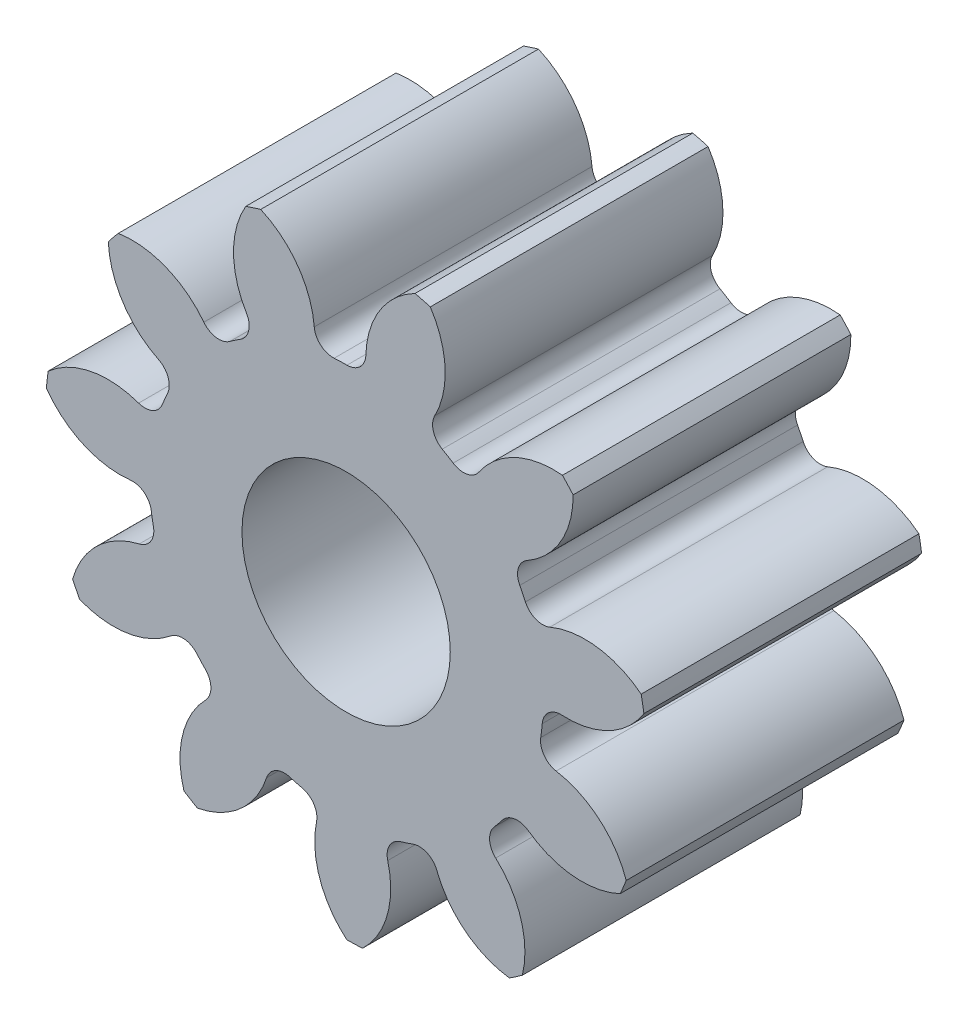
ISO-10303-21;
HEADER;
FILE_DESCRIPTION(('STEP AP214'),'2;1');
FILE_NAME('part.step','',(''),(''),'','','');
FILE_SCHEMA(('AUTOMOTIVE_DESIGN { 1 0 10303 214 1 1 1 1 }'));
ENDSEC;
DATA;
#1=APPLICATION_CONTEXT('core data for automotive mechanical design processes');
#2=APPLICATION_PROTOCOL_DEFINITION('international standard','automotive_design',2000,#1);
#3=PRODUCT_CONTEXT('',#1,'mechanical');
#4=PRODUCT('Part','Part','',(#3));
#5=PRODUCT_RELATED_PRODUCT_CATEGORY('part','',(#4));
#6=PRODUCT_DEFINITION_FORMATION('','',#4);
#7=PRODUCT_DEFINITION_CONTEXT('part definition',#1,'design');
#8=PRODUCT_DEFINITION('design','',#6,#7);
#9=PRODUCT_DEFINITION_SHAPE('','',#8);
#10=(LENGTH_UNIT() NAMED_UNIT(*) SI_UNIT(.MILLI.,.METRE.));
#11=(NAMED_UNIT(*) PLANE_ANGLE_UNIT() SI_UNIT($,.RADIAN.));
#12=(NAMED_UNIT(*) SI_UNIT($,.STERADIAN.) SOLID_ANGLE_UNIT());
#13=UNCERTAINTY_MEASURE_WITH_UNIT(LENGTH_MEASURE(1.E-05),#10,'distance_accuracy_value','');
#14=(GEOMETRIC_REPRESENTATION_CONTEXT(3) GLOBAL_UNCERTAINTY_ASSIGNED_CONTEXT((#13)) GLOBAL_UNIT_ASSIGNED_CONTEXT((#10,
#11,#12)) REPRESENTATION_CONTEXT('',''));
#15=CARTESIAN_POINT('',(0.,0.,0.));
#16=DIRECTION('',(0.,0.,1.));
#17=DIRECTION('',(1.,0.,0.));
#18=AXIS2_PLACEMENT_3D('',#15,#16,#17);
#19=CARTESIAN_POINT('',(0.,0.,101.6));
#20=DIRECTION('',(0.,0.,-1.));
#21=DIRECTION('',(-1.,0.,0.));
#22=AXIS2_PLACEMENT_3D('',#19,#20,#21);
#23=CYLINDRICAL_SURFACE('',#22,110.066666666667);
#24=DIRECTION('',(0.,0.,-1.));
#25=VECTOR('',#24,1.);
#26=CARTESIAN_POINT('',(107.931514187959,21.5745070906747,50.8));
#27=LINE('',#26,#25);
#28=CARTESIAN_POINT('',(107.931514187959,21.5745070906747,101.6));
#29=VERTEX_POINT('',#28);
#30=CARTESIAN_POINT('',(107.931514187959,21.5745070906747,0.));
#31=VERTEX_POINT('',#30);
#32=EDGE_CURVE('E492',#29,#31,#27,.T.);
#33=ORIENTED_EDGE('',*,*,#32,.F.);
#34=CARTESIAN_POINT('',(0.,0.,101.6));
#35=DIRECTION('',(0.,0.,1.));
#36=DIRECTION('',(1.,0.,0.));
#37=AXIS2_PLACEMENT_3D('',#34,#35,#36);
#38=CIRCLE('',#37,110.066666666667);
#39=CARTESIAN_POINT('',(108.91394881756,15.8878212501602,101.6));
#40=VERTEX_POINT('',#39);
#41=EDGE_CURVE('E871',#40,#29,#38,.T.);
#42=ORIENTED_EDGE('',*,*,#41,.F.);
#43=DIRECTION('',(0.,0.,-1.));
#44=VECTOR('',#43,1.);
#45=CARTESIAN_POINT('',(108.91394881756,15.8878212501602,50.8));
#46=LINE('',#45,#44);
#47=CARTESIAN_POINT('',(108.91394881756,15.8878212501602,0.));
#48=VERTEX_POINT('',#47);
#49=EDGE_CURVE('E865',#48,#40,#46,.F.);
#50=ORIENTED_EDGE('',*,*,#49,.F.);
#51=CARTESIAN_POINT('',(0.,0.,0.));
#52=DIRECTION('',(0.,0.,1.));
#53=DIRECTION('',(1.,0.,0.));
#54=AXIS2_PLACEMENT_3D('',#51,#52,#53);
#55=CIRCLE('',#54,110.066666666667);
#56=EDGE_CURVE('E876',#48,#31,#55,.T.);
#57=ORIENTED_EDGE('',*,*,#56,.T.);
#58=EDGE_LOOP('',(#33,#42,#50,#57));
#59=FACE_BOUND('',#58,.T.);
#60=ADVANCED_FACE('F33',(#59),#23,.T.);
#61=DIRECTION('',(0.,0.,-1.));
#62=VECTOR('',#61,1.);
#63=CARTESIAN_POINT('',(83.0346395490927,72.2490120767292,50.8));
#64=LINE('',#63,#62);
#65=CARTESIAN_POINT('',(83.0346395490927,72.2490120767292,0.));
#66=VERTEX_POINT('',#65);
#67=CARTESIAN_POINT('',(83.0346395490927,72.2490120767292,101.6));
#68=VERTEX_POINT('',#67);
#69=EDGE_CURVE('E463',#66,#68,#64,.F.);
#70=ORIENTED_EDGE('',*,*,#69,.F.);
#71=CARTESIAN_POINT('',(79.133708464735,76.50181236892,0.));
#72=VERTEX_POINT('',#71);
#73=EDGE_CURVE('E879',#66,#72,#55,.T.);
#74=ORIENTED_EDGE('',*,*,#73,.T.);
#75=DIRECTION('',(0.,0.,-1.));
#76=VECTOR('',#75,1.);
#77=CARTESIAN_POINT('',(79.133708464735,76.50181236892,50.8));
#78=LINE('',#77,#76);
#79=CARTESIAN_POINT('',(79.133708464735,76.50181236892,101.6));
#80=VERTEX_POINT('',#79);
#81=EDGE_CURVE('E525',#80,#72,#78,.T.);
#82=ORIENTED_EDGE('',*,*,#81,.F.);
#83=EDGE_CURVE('E874',#68,#80,#38,.T.);
#84=ORIENTED_EDGE('',*,*,#83,.F.);
#85=EDGE_LOOP('',(#70,#74,#82,#84));
#86=FACE_BOUND('',#85,.T.);
#87=ADVANCED_FACE('F1006',(#86),#23,.T.);
#88=CARTESIAN_POINT('',(0.,0.,101.6));
#89=DIRECTION('',(0.,0.,1.));
#90=DIRECTION('',(1.,0.,0.));
#91=AXIS2_PLACEMENT_3D('',#88,#89,#90);
#92=PLANE('',#91);
#93=CARTESIAN_POINT('',(0.,0.,101.599999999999));
#94=DIRECTION('',(0.,0.,1.));
#95=DIRECTION('',(1.,0.,0.));
#96=AXIS2_PLACEMENT_3D('',#93,#94,#95);
#97=CIRCLE('',#96,38.1);
#98=CARTESIAN_POINT('',(38.1,0.,101.599999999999));
#99=VERTEX_POINT('',#98);
#100=EDGE_CURVE('E480',#99,#99,#97,.T.);
#101=ORIENTED_EDGE('',*,*,#100,.F.);
#102=EDGE_LOOP('',(#101));
#103=FACE_BOUND('',#102,.T.);
#104=ORIENTED_EDGE('',*,*,#41,.T.);
#105=CARTESIAN_POINT('',(87.4048905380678,-4.42255057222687,101.6));
#106=DIRECTION('',(0.,0.,-1.));
#107=DIRECTION('',(0.841253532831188,0.540640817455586,0.));
#108=AXIS2_PLACEMENT_3D('',#105,#106,#107);
#109=CIRCLE('',#108,33.1238476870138);
#110=CARTESIAN_POINT('',(74.5458975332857,26.1034315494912,101.6));
#111=VERTEX_POINT('',#110);
#112=EDGE_CURVE('E472',#111,#29,#109,.T.);
#113=ORIENTED_EDGE('',*,*,#112,.F.);
#114=CARTESIAN_POINT('',(71.8704092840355,32.4547769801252,101.6));
#115=DIRECTION('',(0.,0.,1.));
#116=DIRECTION('',(-0.841253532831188,-0.540640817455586,0.));
#117=AXIS2_PLACEMENT_3D('',#114,#115,#116);
#118=CIRCLE('',#117,6.89186666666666);
#119=CARTESIAN_POINT('',(65.589271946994,29.6183813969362,101.6));
#120=VERTEX_POINT('',#119);
#121=EDGE_CURVE('E470',#120,#111,#118,.T.);
#122=ORIENTED_EDGE('',*,*,#121,.F.);
#123=CARTESIAN_POINT('',(0.,0.,101.6));
#124=DIRECTION('',(0.,0.,-1.));
#125=DIRECTION('',(0.841253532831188,0.540640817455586,0.));
#126=AXIS2_PLACEMENT_3D('',#123,#124,#125);
#127=CIRCLE('',#126,71.9666666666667);
#128=CARTESIAN_POINT('',(63.5262829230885,33.8173400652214,101.6));
#129=VERTEX_POINT('',#128);
#130=EDGE_CURVE('E455',#129,#120,#127,.T.);
#131=ORIENTED_EDGE('',*,*,#130,.F.);
#132=CARTESIAN_POINT('',(69.6098587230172,37.0558476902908,101.6));
#133=DIRECTION('',(0.,0.,1.));
#134=DIRECTION('',(-0.841253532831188,-0.540640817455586,0.));
#135=AXIS2_PLACEMENT_3D('',#132,#133,#134);
#136=CIRCLE('',#135,6.89186666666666);
#137=CARTESIAN_POINT('',(66.2174468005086,43.0549615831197,101.6));
#138=VERTEX_POINT('',#137);
#139=EDGE_CURVE('E447',#138,#129,#136,.T.);
#140=ORIENTED_EDGE('',*,*,#139,.F.);
#141=CARTESIAN_POINT('',(49.9127587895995,71.8880404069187,101.6));
#142=DIRECTION('',(0.,0.,-1.));
#143=DIRECTION('',(-0.841253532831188,-0.540640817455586,0.));
#144=AXIS2_PLACEMENT_3D('',#141,#142,#143);
#145=CIRCLE('',#144,33.1238476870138);
#146=EDGE_CURVE('E477',#68,#138,#145,.T.);
#147=ORIENTED_EDGE('',*,*,#146,.F.);
#148=ORIENTED_EDGE('',*,*,#83,.T.);
#149=CARTESIAN_POINT('',(75.9206843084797,43.5341651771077,101.6));
#150=DIRECTION('',(0.,0.,-1.));
#151=DIRECTION('',(0.415415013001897,0.909631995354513,0.));
#152=AXIS2_PLACEMENT_3D('',#149,#150,#151);
#153=CIRCLE('',#152,33.1238476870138);
#154=CARTESIAN_POINT('',(48.5994190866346,62.2621589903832,101.6));
#155=VERTEX_POINT('',#154);
#156=EDGE_CURVE('E501',#155,#80,#153,.T.);
#157=ORIENTED_EDGE('',*,*,#156,.F.);
#158=CARTESIAN_POINT('',(42.9148585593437,66.1587726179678,101.6));
#159=DIRECTION('',(0.,0.,1.));
#160=DIRECTION('',(-0.415415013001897,-0.909631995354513,0.));
#161=AXIS2_PLACEMENT_3D('',#158,#159,#160);
#162=CIRCLE('',#161,6.89186666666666);
#163=CARTESIAN_POINT('',(39.1643008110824,60.3768055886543,101.6));
#164=VERTEX_POINT('',#163);
#165=EDGE_CURVE('E499',#164,#155,#162,.T.);
#166=ORIENTED_EDGE('',*,*,#165,.F.);
#167=CARTESIAN_POINT('',(0.,0.,101.6));
#168=DIRECTION('',(0.,0.,-1.));
#169=DIRECTION('',(0.415415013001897,0.909631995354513,0.));
#170=AXIS2_PLACEMENT_3D('',#167,#168,#169);
#171=CIRCLE('',#170,71.9666666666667);
#172=CARTESIAN_POINT('',(35.158675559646,62.7938583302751,101.6));
#173=VERTEX_POINT('',#172);
#174=EDGE_CURVE('E496',#173,#164,#171,.T.);
#175=ORIENTED_EDGE('',*,*,#174,.F.);
#176=CARTESIAN_POINT('',(38.5256357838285,68.8072937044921,101.6));
#177=DIRECTION('',(0.,0.,1.));
#178=DIRECTION('',(-0.415415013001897,-0.909631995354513,0.));
#179=AXIS2_PLACEMENT_3D('',#176,#177,#178);
#180=CIRCLE('',#179,6.89186666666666);
#181=CARTESIAN_POINT('',(32.4283914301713,72.0199931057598,101.6));
#182=VERTEX_POINT('',#181);
#183=EDGE_CURVE('E494',#182,#173,#180,.T.);
#184=ORIENTED_EDGE('',*,*,#183,.F.);
#185=CARTESIAN_POINT('',(3.1236757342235,87.4609426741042,101.6));
#186=DIRECTION('',(0.,0.,-1.));
#187=DIRECTION('',(-0.415415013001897,-0.909631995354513,0.));
#188=AXIS2_PLACEMENT_3D('',#185,#186,#187);
#189=CIRCLE('',#188,33.1238476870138);
#190=CARTESIAN_POINT('',(30.7924189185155,105.671652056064,101.6));
#191=VERTEX_POINT('',#190);
#192=EDGE_CURVE('E504',#191,#182,#189,.T.);
#193=ORIENTED_EDGE('',*,*,#192,.F.);
#194=CARTESIAN_POINT('',(25.2115094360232,107.140332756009,101.6));
#195=VERTEX_POINT('',#194);
#196=EDGE_CURVE('E909',#191,#195,#38,.T.);
#197=ORIENTED_EDGE('',*,*,#196,.T.);
#198=CARTESIAN_POINT('',(40.3321972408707,77.6690910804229,101.6));
#199=DIRECTION('',(0.,0.,-1.));
#200=DIRECTION('',(-0.142314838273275,0.989821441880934,0.));
#201=AXIS2_PLACEMENT_3D('',#198,#199,#200);
#202=CIRCLE('',#201,33.1238476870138);
#203=CARTESIAN_POINT('',(7.22296846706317,78.6530908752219,101.6));
#204=VERTEX_POINT('',#203);
#205=EDGE_CURVE('E536',#204,#195,#202,.T.);
#206=ORIENTED_EDGE('',*,*,#205,.F.);
#207=CARTESIAN_POINT('',(0.334143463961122,78.8578254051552,101.6));
#208=DIRECTION('',(0.,0.,1.));
#209=DIRECTION('',(0.142314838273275,-0.989821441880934,0.));
#210=AXIS2_PLACEMENT_3D('',#207,#208,#209);
#211=CIRCLE('',#210,6.89186666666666);
#212=CARTESIAN_POINT('',(0.304940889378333,71.9660206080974,101.6));
#213=VERTEX_POINT('',#212);
#214=EDGE_CURVE('E534',#213,#204,#211,.T.);
#215=ORIENTED_EDGE('',*,*,#214,.F.);
#216=CARTESIAN_POINT('',(0.,0.,101.6));
#217=DIRECTION('',(0.,0.,-1.));
#218=DIRECTION('',(-0.142314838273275,0.989821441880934,0.));
#219=AXIS2_PLACEMENT_3D('',#216,#217,#218);
#220=CIRCLE('',#219,71.9666666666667);
#221=CARTESIAN_POINT('',(-4.37156287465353,71.8337702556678,101.6));
#222=VERTEX_POINT('',#221);
#223=EDGE_CURVE('E531',#222,#213,#220,.T.);
#224=ORIENTED_EDGE('',*,*,#223,.F.);
#225=CARTESIAN_POINT('',(-4.79020430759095,78.7129101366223,101.6));
#226=DIRECTION('',(0.,0.,1.));
#227=DIRECTION('',(0.142314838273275,-0.989821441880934,0.));
#228=AXIS2_PLACEMENT_3D('',#225,#226,#227);
#229=CIRCLE('',#228,6.89186666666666);
#230=CARTESIAN_POINT('',(-11.6564490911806,78.1191856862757,101.6));
#231=VERTEX_POINT('',#230);
#232=EDGE_CURVE('E529',#231,#222,#229,.T.);
#233=ORIENTED_EDGE('',*,*,#232,.F.);
#234=CARTESIAN_POINT('',(-44.6571522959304,75.2656136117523,101.6));
#235=DIRECTION('',(0.,0.,-1.));
#236=DIRECTION('',(0.142314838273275,-0.989821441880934,0.));
#237=AXIS2_PLACEMENT_3D('',#234,#235,#236);
#238=CIRCLE('',#237,33.1238476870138);
#239=CARTESIAN_POINT('',(-31.2261771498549,105.544289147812,101.6));
#240=VERTEX_POINT('',#239);
#241=EDGE_CURVE('E539',#240,#231,#238,.T.);
#242=ORIENTED_EDGE('',*,*,#241,.F.);
#243=CARTESIAN_POINT('',(-36.7151657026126,103.762554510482,101.6));
#244=VERTEX_POINT('',#243);
#245=EDGE_CURVE('E988',#240,#244,#38,.T.);
#246=ORIENTED_EDGE('',*,*,#245,.T.);
#247=CARTESIAN_POINT('',(-8.06147747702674,87.1446293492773,101.6));
#248=DIRECTION('',(0.,0.,-1.));
#249=DIRECTION('',(-0.654860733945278,0.755749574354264,0.));
#250=AXIS2_PLACEMENT_3D('',#247,#248,#249);
#251=CIRCLE('',#250,33.1238476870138);
#252=CARTESIAN_POINT('',(-36.4467236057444,70.0722221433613,101.6));
#253=VERTEX_POINT('',#252);
#254=EDGE_CURVE('E574',#253,#244,#251,.T.);
#255=ORIENTED_EDGE('',*,*,#254,.F.);
#256=CARTESIAN_POINT('',(-42.3526598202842,66.5200758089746,101.6));
#257=DIRECTION('',(0.,0.,1.));
#258=DIRECTION('',(0.654860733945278,-0.755749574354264,0.));
#259=AXIS2_PLACEMENT_3D('',#256,#257,#258);
#260=CIRCLE('',#259,6.89186666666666);
#261=CARTESIAN_POINT('',(-38.651235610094,60.7065325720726,101.6));
#262=VERTEX_POINT('',#261);
#263=EDGE_CURVE('E572',#262,#253,#260,.T.);
#264=ORIENTED_EDGE('',*,*,#263,.F.);
#265=CARTESIAN_POINT('',(0.,0.,101.6));
#266=DIRECTION('',(0.,0.,-1.));
#267=DIRECTION('',(-0.654860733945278,0.755749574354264,0.));
#268=AXIS2_PLACEMENT_3D('',#265,#266,#267);
#269=CIRCLE('',#268,71.9666666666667);
#270=CARTESIAN_POINT('',(-42.5138609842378,58.0669676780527,101.6));
#271=VERTEX_POINT('',#270);
#272=EDGE_CURVE('E569',#271,#262,#269,.T.);
#273=ORIENTED_EDGE('',*,*,#272,.F.);
#274=CARTESIAN_POINT('',(-46.5851883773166,63.6277337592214,101.6));
#275=DIRECTION('',(0.,0.,1.));
#276=DIRECTION('',(0.654860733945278,-0.755749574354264,0.));
#277=AXIS2_PLACEMENT_3D('',#274,#275,#276);
#278=CIRCLE('',#277,6.89186666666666);
#279=CARTESIAN_POINT('',(-52.0404493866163,59.416088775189,101.6));
#280=VERTEX_POINT('',#279);
#281=EDGE_CURVE('E567',#280,#271,#278,.T.);
#282=ORIENTED_EDGE('',*,*,#281,.F.);
#283=CARTESIAN_POINT('',(-78.2596500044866,39.1739840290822,101.6));
#284=DIRECTION('',(0.,0.,-1.));
#285=DIRECTION('',(0.654860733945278,-0.755749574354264,0.));
#286=AXIS2_PLACEMENT_3D('',#283,#284,#285);
#287=CIRCLE('',#286,33.1238476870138);
#288=CARTESIAN_POINT('',(-83.330682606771,71.9073601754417,101.6));
#289=VERTEX_POINT('',#288);
#290=EDGE_CURVE('E577',#289,#280,#287,.T.);
#291=ORIENTED_EDGE('',*,*,#290,.F.);
#292=CARTESIAN_POINT('',(-86.9850351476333,67.4408983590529,101.6));
#293=VERTEX_POINT('',#292);
#294=EDGE_CURVE('E984',#289,#293,#38,.T.);
#295=ORIENTED_EDGE('',*,*,#294,.T.);
#296=CARTESIAN_POINT('',(-53.8956900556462,68.9523635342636,101.6));
#297=DIRECTION('',(0.,0.,-1.));
#298=DIRECTION('',(-0.959492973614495,0.281732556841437,0.));
#299=AXIS2_PLACEMENT_3D('',#296,#297,#298);
#300=CIRCLE('',#299,33.1238476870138);
#301=CARTESIAN_POINT('',(-68.5448384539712,39.2439179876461,101.6));
#302=VERTEX_POINT('',#301);
#303=EDGE_CURVE('E612',#302,#293,#300,.T.);
#304=ORIENTED_EDGE('',*,*,#303,.F.);
#305=CARTESIAN_POINT('',(-71.5927928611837,33.0626721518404,101.6));
#306=DIRECTION('',(0.,0.,1.));
#307=DIRECTION('',(0.959492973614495,-0.281732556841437,0.));
#308=AXIS2_PLACEMENT_3D('',#305,#306,#307);
#309=CIRCLE('',#308,6.89186666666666);
#310=CARTESIAN_POINT('',(-65.3359178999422,30.173149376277,101.6));
#311=VERTEX_POINT('',#310);
#312=EDGE_CURVE('E610',#311,#302,#309,.T.);
#313=ORIENTED_EDGE('',*,*,#312,.F.);
#314=CARTESIAN_POINT('',(0.,0.,101.6));
#315=DIRECTION('',(0.,0.,-1.));
#316=DIRECTION('',(-0.959492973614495,0.281732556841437,0.));
#317=AXIS2_PLACEMENT_3D('',#314,#315,#316);
#318=CIRCLE('',#317,71.9666666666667);
#319=CARTESIAN_POINT('',(-67.158308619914,25.8643131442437,101.6));
#320=VERTEX_POINT('',#319);
#321=EDGE_CURVE('E607',#320,#311,#318,.T.);
#322=ORIENTED_EDGE('',*,*,#321,.F.);
#323=CARTESIAN_POINT('',(-73.5897042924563,28.3412014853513,101.6));
#324=DIRECTION('',(0.,0.,1.));
#325=DIRECTION('',(0.959492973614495,-0.281732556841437,0.));
#326=AXIS2_PLACEMENT_3D('',#323,#324,#325);
#327=CIRCLE('',#326,6.89186666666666);
#328=CARTESIAN_POINT('',(-75.9019747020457,21.8488034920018,101.6));
#329=VERTEX_POINT('',#328);
#330=EDGE_CURVE('E605',#329,#320,#327,.T.);
#331=ORIENTED_EDGE('',*,*,#330,.F.);
#332=CARTESIAN_POINT('',(-87.0152617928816,-9.35510869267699,101.6));
#333=DIRECTION('',(0.,0.,-1.));
#334=DIRECTION('',(0.959492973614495,-0.281732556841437,0.));
#335=AXIS2_PLACEMENT_3D('',#332,#333,#334);
#336=CIRCLE('',#335,33.1238476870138);
#337=CARTESIAN_POINT('',(-108.978285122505,15.4403524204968,101.6));
#338=VERTEX_POINT('',#337);
#339=EDGE_CURVE('E615',#338,#329,#336,.T.);
#340=ORIENTED_EDGE('',*,*,#339,.F.);
#341=CARTESIAN_POINT('',(-109.637770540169,9.70723349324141,101.6));
#342=VERTEX_POINT('',#341);
#343=EDGE_CURVE('E980',#338,#342,#38,.T.);
#344=ORIENTED_EDGE('',*,*,#343,.T.);
#345=CARTESIAN_POINT('',(-82.6184018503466,28.8682094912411,101.6));
#346=DIRECTION('',(0.,0.,-1.));
#347=DIRECTION('',(-0.959492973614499,-0.281732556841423,0.));
#348=AXIS2_PLACEMENT_3D('',#345,#346,#347);
#349=CIRCLE('',#348,33.1238476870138);
#350=CARTESIAN_POINT('',(-78.8804514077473,-4.04405284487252,101.6));
#351=VERTEX_POINT('',#350);
#352=EDGE_CURVE('E650',#351,#342,#349,.T.);
#353=ORIENTED_EDGE('',*,*,#352,.F.);
#354=CARTESIAN_POINT('',(-78.1027200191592,-10.8918963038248,101.6));
#355=DIRECTION('',(0.,0.,1.));
#356=DIRECTION('',(0.959492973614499,0.281732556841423,0.));
#357=AXIS2_PLACEMENT_3D('',#354,#355,#356);
#358=CIRCLE('',#357,6.89186666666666);
#359=CARTESIAN_POINT('',(-71.2769078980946,-9.93999555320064,101.6));
#360=VERTEX_POINT('',#359);
#361=EDGE_CURVE('E648',#360,#351,#358,.T.);
#362=ORIENTED_EDGE('',*,*,#361,.F.);
#363=CARTESIAN_POINT('',(0.,0.,101.6));
#364=DIRECTION('',(0.,0.,-1.));
#365=DIRECTION('',(-0.959492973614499,-0.281732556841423,0.));
#366=AXIS2_PLACEMENT_3D('',#363,#364,#365);
#367=CIRCLE('',#366,71.9666666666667);
#368=CARTESIAN_POINT('',(-70.4804677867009,-14.5500780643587,101.6));
#369=VERTEX_POINT('',#368);
#370=EDGE_CURVE('E645',#369,#360,#367,.T.);
#371=ORIENTED_EDGE('',*,*,#370,.F.);
#372=CARTESIAN_POINT('',(-77.2300090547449,-15.9434620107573,101.6));
#373=DIRECTION('',(0.,0.,1.));
#374=DIRECTION('',(0.959492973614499,0.281732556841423,0.));
#375=AXIS2_PLACEMENT_3D('',#372,#373,#374);
#376=CIRCLE('',#375,6.89186666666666);
#377=CARTESIAN_POINT('',(-75.6651593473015,-22.6553225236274,101.6));
#378=VERTEX_POINT('',#377);
#379=EDGE_CURVE('E643',#378,#369,#376,.T.);
#380=ORIENTED_EDGE('',*,*,#379,.F.);
#381=CARTESIAN_POINT('',(-68.1441427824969,-54.9140205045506,101.6));
#382=DIRECTION('',(0.,0.,-1.));
#383=DIRECTION('',(0.959492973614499,0.281732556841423,0.));
#384=AXIS2_PLACEMENT_3D('',#381,#382,#383);
#385=CIRCLE('',#384,33.1238476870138);
#386=CARTESIAN_POINT('',(-100.026052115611,-45.9288581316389,101.6));
#387=VERTEX_POINT('',#386);
#388=EDGE_CURVE('E653',#387,#378,#385,.T.);
#389=ORIENTED_EDGE('',*,*,#388,.F.);
#390=CARTESIAN_POINT('',(-97.4812884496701,-51.10840941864,101.6));
#391=VERTEX_POINT('',#390);
#392=EDGE_CURVE('E976',#387,#391,#38,.T.);
#393=ORIENTED_EDGE('',*,*,#392,.T.);
#394=CARTESIAN_POINT('',(-85.1103548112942,-20.3813970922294,101.6));
#395=DIRECTION('',(0.,0.,-1.));
#396=DIRECTION('',(-0.654860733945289,-0.755749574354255,0.));
#397=AXIS2_PLACEMENT_3D('',#394,#395,#396);
#398=CIRCLE('',#397,33.1238476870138);
#399=CARTESIAN_POINT('',(-64.1720783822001,-46.0480654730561,101.6));
#400=VERTEX_POINT('',#399);
#401=EDGE_CURVE('E688',#400,#391,#398,.T.);
#402=ORIENTED_EDGE('',*,*,#401,.F.);
#403=CARTESIAN_POINT('',(-59.8155854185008,-51.3883646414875,101.6));
#404=DIRECTION('',(0.,0.,1.));
#405=DIRECTION('',(0.654860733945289,0.755749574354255,0.));
#406=AXIS2_PLACEMENT_3D('',#403,#404,#405);
#407=CIRCLE('',#406,6.89186666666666);
#408=CARTESIAN_POINT('',(-54.5879832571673,-46.8972621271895,101.6));
#409=VERTEX_POINT('',#408);
#410=EDGE_CURVE('E686',#409,#400,#407,.T.);
#411=ORIENTED_EDGE('',*,*,#410,.F.);
#412=CARTESIAN_POINT('',(0.,0.,101.6));
#413=DIRECTION('',(0.,0.,-1.));
#414=DIRECTION('',(-0.654860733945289,-0.755749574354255,0.));
#415=AXIS2_PLACEMENT_3D('',#412,#413,#414);
#416=CIRCLE('',#415,71.9666666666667);
#417=CARTESIAN_POINT('',(-51.4255764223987,-50.3449222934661,101.6));
#418=VERTEX_POINT('',#417);
#419=EDGE_CURVE('E683',#418,#409,#416,.T.);
#420=ORIENTED_EDGE('',*,*,#419,.F.);
#421=CARTESIAN_POINT('',(-56.3503316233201,-55.1661889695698,101.6));
#422=DIRECTION('',(0.,0.,1.));
#423=DIRECTION('',(0.654860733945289,0.755749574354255,0.));
#424=AXIS2_PLACEMENT_3D('',#421,#422,#423);
#425=CIRCLE('',#424,6.89186666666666);
#426=CARTESIAN_POINT('',(-51.4051905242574,-59.9665437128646,101.6));
#427=VERTEX_POINT('',#426);
#428=EDGE_CURVE('E681',#427,#418,#425,.T.);
#429=ORIENTED_EDGE('',*,*,#428,.F.);
#430=CARTESIAN_POINT('',(-27.6377399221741,-83.0381188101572,101.6));
#431=DIRECTION('',(0.,0.,-1.));
#432=DIRECTION('',(0.654860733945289,0.755749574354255,0.));
#433=AXIS2_PLACEMENT_3D('',#430,#431,#432);
#434=CIRCLE('',#433,33.1238476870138);
#435=CARTESIAN_POINT('',(-59.3162543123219,-92.7159807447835,101.6));
#436=VERTEX_POINT('',#435);
#437=EDGE_CURVE('E691',#436,#427,#434,.T.);
#438=ORIENTED_EDGE('',*,*,#437,.F.);
#439=CARTESIAN_POINT('',(-54.3751860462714,-95.6974934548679,101.6));
#440=VERTEX_POINT('',#439);
#441=EDGE_CURVE('E972',#436,#440,#38,.T.);
#442=ORIENTED_EDGE('',*,*,#441,.T.);
#443=CARTESIAN_POINT('',(-60.5803714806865,-63.1600541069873,101.6));
#444=DIRECTION('',(0.,0.,-1.));
#445=DIRECTION('',(-0.142314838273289,-0.989821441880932,0.));
#446=AXIS2_PLACEMENT_3D('',#443,#444,#445);
#447=CIRCLE('',#446,33.1238476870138);
#448=CARTESIAN_POINT('',(-29.0895238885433,-73.4321426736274,101.6));
#449=VERTEX_POINT('',#448);
#450=EDGE_CURVE('E726',#449,#440,#447,.T.);
#451=ORIENTED_EDGE('',*,*,#450,.F.);
#452=CARTESIAN_POINT('',(-22.5374250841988,-75.5693902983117,101.6));
#453=DIRECTION('',(0.,0.,1.));
#454=DIRECTION('',(0.142314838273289,0.989821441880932,0.));
#455=AXIS2_PLACEMENT_3D('',#452,#453,#454);
#456=CIRCLE('',#455,6.89186666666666);
#457=CARTESIAN_POINT('',(-20.5677596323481,-68.9649793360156,101.6));
#458=VERTEX_POINT('',#457);
#459=EDGE_CURVE('E724',#458,#449,#456,.T.);
#460=ORIENTED_EDGE('',*,*,#459,.F.);
#461=CARTESIAN_POINT('',(0.,0.,101.6));
#462=DIRECTION('',(0.,0.,-1.));
#463=DIRECTION('',(-0.142314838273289,-0.989821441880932,0.));
#464=AXIS2_PLACEMENT_3D('',#461,#462,#463);
#465=CIRCLE('',#464,71.9666666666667);
#466=CARTESIAN_POINT('',(-16.0434278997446,-70.1556094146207,101.6));
#467=VERTEX_POINT('',#466);
#468=EDGE_CURVE('E721',#467,#458,#465,.T.);
#469=ORIENTED_EDGE('',*,*,#468,.F.);
#470=CARTESIAN_POINT('',(-17.5798220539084,-76.874040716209,101.6));
#471=DIRECTION('',(0.,0.,1.));
#472=DIRECTION('',(0.142314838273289,0.989821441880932,0.));
#473=AXIS2_PLACEMENT_3D('',#470,#471,#472);
#474=CIRCLE('',#473,6.89186666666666);
#475=CARTESIAN_POINT('',(-10.8244369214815,-78.2388109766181,101.6));
#476=VERTEX_POINT('',#475);
#477=EDGE_CURVE('E719',#476,#467,#474,.T.);
#478=ORIENTED_EDGE('',*,*,#477,.F.);
#479=CARTESIAN_POINT('',(21.6434500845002,-84.7982011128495,101.6));
#480=DIRECTION('',(0.,0.,-1.));
#481=DIRECTION('',(0.142314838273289,0.989821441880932,0.));
#482=AXIS2_PLACEMENT_3D('',#479,#480,#481);
#483=CIRCLE('',#482,33.1238476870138);
#484=CARTESIAN_POINT('',(0.226035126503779,-110.066434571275,101.6));
#485=VERTEX_POINT('',#484);
#486=EDGE_CURVE('E729',#485,#476,#483,.T.);
#487=ORIENTED_EDGE('',*,*,#486,.F.);
#488=CARTESIAN_POINT('',(5.99465373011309,-109.903299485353,101.6));
#489=VERTEX_POINT('',#488);
#490=EDGE_CURVE('E968',#485,#489,#38,.T.);
#491=ORIENTED_EDGE('',*,*,#490,.T.);
#492=CARTESIAN_POINT('',(-16.8165482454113,-85.8858402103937,101.6));
#493=DIRECTION('',(0.,0.,-1.));
#494=DIRECTION('',(0.415415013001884,-0.909631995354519,0.));
#495=AXIS2_PLACEMENT_3D('',#492,#493,#494);
#496=CIRCLE('',#495,33.1238476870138);
#497=CARTESIAN_POINT('',(15.228748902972,-77.5020334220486,101.6));
#498=VERTEX_POINT('',#497);
#499=EDGE_CURVE('E764',#498,#489,#496,.T.);
#500=ORIENTED_EDGE('',*,*,#499,.F.);
#501=CARTESIAN_POINT('',(21.8962084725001,-75.7576684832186,101.6));
#502=DIRECTION('',(0.,0.,1.));
#503=DIRECTION('',(-0.415415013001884,0.909631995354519,0.));
#504=AXIS2_PLACEMENT_3D('',#501,#502,#503);
#505=CIRCLE('',#504,6.89186666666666);
#506=CARTESIAN_POINT('',(19.9825823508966,-69.1368028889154,101.6));
#507=VERTEX_POINT('',#506);
#508=EDGE_CURVE('E762',#507,#498,#505,.T.);
#509=ORIENTED_EDGE('',*,*,#508,.F.);
#510=CARTESIAN_POINT('',(0.,0.,101.6));
#511=DIRECTION('',(0.,0.,-1.));
#512=DIRECTION('',(0.415415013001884,-0.909631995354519,0.));
#513=AXIS2_PLACEMENT_3D('',#510,#511,#512);
#514=CIRCLE('',#513,71.9666666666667);
#515=CARTESIAN_POINT('',(24.4323956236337,-67.6923862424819,101.6));
#516=VERTEX_POINT('',#515);
#517=EDGE_CURVE('E759',#516,#507,#514,.T.);
#518=ORIENTED_EDGE('',*,*,#517,.F.);
#519=CARTESIAN_POINT('',(26.7721568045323,-74.1749277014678,101.6));
#520=DIRECTION('',(0.,0.,1.));
#521=DIRECTION('',(-0.415415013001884,0.909631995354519,0.));
#522=AXIS2_PLACEMENT_3D('',#519,#520,#521);
#523=CIRCLE('',#522,6.89186666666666);
#524=CARTESIAN_POINT('',(33.1929989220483,-71.6708085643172,101.6));
#525=VERTEX_POINT('',#524);
#526=EDGE_CURVE('E757',#525,#516,#523,.T.);
#527=ORIENTED_EDGE('',*,*,#526,.F.);
#528=CARTESIAN_POINT('',(64.0529976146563,-59.6354537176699,101.6));
#529=DIRECTION('',(0.,0.,-1.));
#530=DIRECTION('',(-0.415415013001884,0.909631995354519,0.));
#531=AXIS2_PLACEMENT_3D('',#528,#529,#530);
#532=CIRCLE('',#531,33.1238476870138);
#533=CARTESIAN_POINT('',(59.6965600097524,-92.4715731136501,101.6));
#534=VERTEX_POINT('',#533);
#535=EDGE_CURVE('E767',#534,#525,#532,.T.);
#536=ORIENTED_EDGE('',*,*,#535,.F.);
#537=CARTESIAN_POINT('',(64.4612333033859,-89.2155844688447,101.6));
#538=VERTEX_POINT('',#537);
#539=EDGE_CURVE('E967',#534,#538,#38,.T.);
#540=ORIENTED_EDGE('',*,*,#539,.T.);
#541=CARTESIAN_POINT('',(32.2864102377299,-81.3434788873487,101.6));
#542=DIRECTION('',(0.,0.,-1.));
#543=DIRECTION('',(0.841253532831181,-0.540640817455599,0.));
#544=AXIS2_PLACEMENT_3D('',#541,#542,#543);
#545=CIRCLE('',#544,33.1238476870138);
#546=CARTESIAN_POINT('',(54.7120015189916,-56.9655761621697,101.6));
#547=VERTEX_POINT('',#546);
#548=EDGE_CURVE('E802',#547,#538,#545,.T.);
#549=ORIENTED_EDGE('',*,*,#548,.F.);
#550=CARTESIAN_POINT('',(59.3779505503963,-51.8934222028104,101.6));
#551=DIRECTION('',(0.,0.,1.));
#552=DIRECTION('',(-0.841253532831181,0.540640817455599,0.));
#553=AXIS2_PLACEMENT_3D('',#550,#551,#552);
#554=CIRCLE('',#553,6.89186666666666);
#555=CARTESIAN_POINT('',(54.1885956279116,-47.3581800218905,101.6));
#556=VERTEX_POINT('',#555);
#557=EDGE_CURVE('E800',#556,#547,#554,.T.);
#558=ORIENTED_EDGE('',*,*,#557,.F.);
#559=CARTESIAN_POINT('',(0.,0.,101.6));
#560=DIRECTION('',(0.,0.,-1.));
#561=DIRECTION('',(0.841253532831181,-0.540640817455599,0.));
#562=AXIS2_PLACEMENT_3D('',#559,#560,#561);
#563=CIRCLE('',#562,71.9666666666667);
#564=CARTESIAN_POINT('',(57.1511061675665,-43.7373087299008,101.6));
#565=VERTEX_POINT('',#564);
#566=EDGE_CURVE('E797',#565,#556,#563,.T.);
#567=ORIENTED_EDGE('',*,*,#566,.F.);
#568=CARTESIAN_POINT('',(62.6241650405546,-47.9257992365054,101.6));
#569=DIRECTION('',(0.,0.,1.));
#570=DIRECTION('',(-0.841253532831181,0.540640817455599,0.));
#571=AXIS2_PLACEMENT_3D('',#568,#569,#570);
#572=CIRCLE('',#571,6.89186666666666);
#573=CARTESIAN_POINT('',(66.6718921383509,-42.3478308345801,101.6));
#574=VERTEX_POINT('',#573);
#575=EDGE_CURVE('E795',#574,#565,#572,.T.);
#576=ORIENTED_EDGE('',*,*,#575,.F.);
#577=CARTESIAN_POINT('',(86.1261709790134,-15.5388711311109,101.6));
#578=DIRECTION('',(0.,0.,-1.));
#579=DIRECTION('',(-0.841253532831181,0.540640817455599,0.));
#580=AXIS2_PLACEMENT_3D('',#577,#578,#579);
#581=CIRCLE('',#580,33.1238476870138);
#582=CARTESIAN_POINT('',(100.213848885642,-45.5176405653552,101.6));
#583=VERTEX_POINT('',#582);
#584=EDGE_CURVE('E805',#583,#574,#581,.T.);
#585=ORIENTED_EDGE('',*,*,#584,.F.);
#586=CARTESIAN_POINT('',(102.461826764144,-40.2025517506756,101.6));
#587=VERTEX_POINT('',#586);
#588=EDGE_CURVE('E875',#583,#587,#38,.T.);
#589=ORIENTED_EDGE('',*,*,#588,.T.);
#590=CARTESIAN_POINT('',(71.1386615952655,-50.9751377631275,101.6));
#591=DIRECTION('',(0.,0.,-1.));
#592=DIRECTION('',(1.,0.,0.));
#593=AXIS2_PLACEMENT_3D('',#590,#591,#592);
#594=CIRCLE('',#593,33.1238476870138);
#595=CARTESIAN_POINT('',(76.8245802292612,-18.3429509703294,101.6));
#596=VERTEX_POINT('',#595);
#597=EDGE_CURVE('E840',#596,#587,#594,.T.);
#598=ORIENTED_EDGE('',*,*,#597,.F.);
#599=CARTESIAN_POINT('',(78.0076128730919,-11.5533810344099,101.6));
#600=DIRECTION('',(0.,0.,1.));
#601=DIRECTION('',(-1.,0.,0.));
#602=AXIS2_PLACEMENT_3D('',#599,#600,#601);
#603=CIRCLE('',#602,6.89186666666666);
#604=CARTESIAN_POINT('',(71.1901126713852,-10.5436696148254,101.6));
#605=VERTEX_POINT('',#604);
#606=EDGE_CURVE('E838',#605,#596,#603,.T.);
#607=ORIENTED_EDGE('',*,*,#606,.F.);
#608=CARTESIAN_POINT('',(0.,0.,101.6));
#609=DIRECTION('',(0.,0.,-1.));
#610=DIRECTION('',(1.,0.,0.));
#611=AXIS2_PLACEMENT_3D('',#608,#609,#610);
#612=CIRCLE('',#611,71.9666666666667);
#613=CARTESIAN_POINT('',(71.7247443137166,-5.89594472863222,101.6));
#614=VERTEX_POINT('',#613);
#615=EDGE_CURVE('E835',#614,#605,#612,.T.);
#616=ORIENTED_EDGE('',*,*,#615,.F.);
#617=CARTESIAN_POINT('',(78.5934433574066,-6.46056814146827,101.6));
#618=DIRECTION('',(0.,0.,1.));
#619=DIRECTION('',(-1.,0.,0.));
#620=AXIS2_PLACEMENT_3D('',#617,#618,#619);
#621=CIRCLE('',#620,6.89186666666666);
#622=CARTESIAN_POINT('',(78.9829306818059,0.420283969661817,101.6));
#623=VERTEX_POINT('',#622);
#624=EDGE_CURVE('E833',#623,#614,#621,.T.);
#625=ORIENTED_EDGE('',*,*,#624,.F.);
#626=CARTESIAN_POINT('',(80.8548935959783,33.491193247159,101.6));
#627=DIRECTION('',(0.,0.,-1.));
#628=DIRECTION('',(-1.,0.,0.));
#629=AXIS2_PLACEMENT_3D('',#626,#627,#628);
#630=CIRCLE('',#629,33.1238476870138);
#631=EDGE_CURVE('E843',#40,#623,#630,.T.);
#632=ORIENTED_EDGE('',*,*,#631,.F.);
#633=EDGE_LOOP('',(#104,#113,#122,#131,#140,#147,#148,#157,#166,#175,#184,#193,#197,#206,#215,
#224,#233,#242,#246,#255,#264,#273,#282,#291,#295,#304,#313,#322,#331,#340,#344,#353,#362,#371,
#380,#389,#393,#402,#411,#420,#429,#438,#442,#451,#460,#469,#478,#487,#491,#500,#509,#518,#527,
#536,#540,#549,#558,#567,#576,#585,#589,#598,#607,#616,#625,#632));
#634=FACE_BOUND('',#633,.T.);
#635=ADVANCED_FACE('F468',(#103,#634),#92,.T.);
#636=CARTESIAN_POINT('',(0.,0.,0.));
#637=DIRECTION('',(0.,0.,1.));
#638=DIRECTION('',(1.,0.,0.));
#639=AXIS2_PLACEMENT_3D('',#636,#637,#638);
#640=PLANE('',#639);
#641=CARTESIAN_POINT('',(0.,0.,0.));
#642=DIRECTION('',(0.,0.,1.));
#643=DIRECTION('',(1.,0.,0.));
#644=AXIS2_PLACEMENT_3D('',#641,#642,#643);
#645=CIRCLE('',#644,38.1);
#646=CARTESIAN_POINT('',(38.1,0.,-1.77635683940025E-12));
#647=VERTEX_POINT('',#646);
#648=EDGE_CURVE('E36',#647,#647,#645,.T.);
#649=ORIENTED_EDGE('',*,*,#648,.T.);
#650=EDGE_LOOP('',(#649));
#651=FACE_BOUND('',#650,.T.);
#652=CARTESIAN_POINT('',(87.4048905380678,-4.42255057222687,0.));
#653=DIRECTION('',(0.,0.,-1.));
#654=DIRECTION('',(0.841253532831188,0.540640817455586,0.));
#655=AXIS2_PLACEMENT_3D('',#652,#653,#654);
#656=CIRCLE('',#655,33.1238476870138);
#657=CARTESIAN_POINT('',(74.5458975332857,26.1034315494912,0.));
#658=VERTEX_POINT('',#657);
#659=EDGE_CURVE('E456',#658,#31,#656,.T.);
#660=ORIENTED_EDGE('',*,*,#659,.T.);
#661=ORIENTED_EDGE('',*,*,#56,.F.);
#662=CARTESIAN_POINT('',(80.8548935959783,33.491193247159,0.));
#663=DIRECTION('',(0.,0.,1.));
#664=DIRECTION('',(1.,0.,0.));
#665=AXIS2_PLACEMENT_3D('',#662,#663,#664);
#666=CIRCLE('',#665,33.1238476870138);
#667=CARTESIAN_POINT('',(78.9829306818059,0.420283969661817,0.));
#668=VERTEX_POINT('',#667);
#669=EDGE_CURVE('E873',#668,#48,#666,.T.);
#670=ORIENTED_EDGE('',*,*,#669,.F.);
#671=CARTESIAN_POINT('',(78.5934433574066,-6.46056814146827,0.));
#672=DIRECTION('',(0.,0.,1.));
#673=DIRECTION('',(-1.,0.,0.));
#674=AXIS2_PLACEMENT_3D('',#671,#672,#673);
#675=CIRCLE('',#674,6.89186666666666);
#676=CARTESIAN_POINT('',(71.7247443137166,-5.89594472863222,0.));
#677=VERTEX_POINT('',#676);
#678=EDGE_CURVE('E832',#668,#677,#675,.T.);
#679=ORIENTED_EDGE('',*,*,#678,.T.);
#680=CARTESIAN_POINT('',(0.,0.,0.));
#681=DIRECTION('',(0.,0.,-1.));
#682=DIRECTION('',(1.,0.,0.));
#683=AXIS2_PLACEMENT_3D('',#680,#681,#682);
#684=CIRCLE('',#683,71.9666666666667);
#685=CARTESIAN_POINT('',(71.1901126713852,-10.5436696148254,0.));
#686=VERTEX_POINT('',#685);
#687=EDGE_CURVE('E848',#677,#686,#684,.T.);
#688=ORIENTED_EDGE('',*,*,#687,.T.);
#689=CARTESIAN_POINT('',(78.0076128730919,-11.5533810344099,0.));
#690=DIRECTION('',(0.,0.,1.));
#691=DIRECTION('',(-1.,0.,0.));
#692=AXIS2_PLACEMENT_3D('',#689,#690,#691);
#693=CIRCLE('',#692,6.89186666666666);
#694=CARTESIAN_POINT('',(76.8245802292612,-18.3429509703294,0.));
#695=VERTEX_POINT('',#694);
#696=EDGE_CURVE('E851',#686,#695,#693,.T.);
#697=ORIENTED_EDGE('',*,*,#696,.T.);
#698=CARTESIAN_POINT('',(71.1386615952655,-50.9751377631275,0.));
#699=DIRECTION('',(0.,0.,-1.));
#700=DIRECTION('',(1.,0.,0.));
#701=AXIS2_PLACEMENT_3D('',#698,#699,#700);
#702=CIRCLE('',#701,33.1238476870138);
#703=CARTESIAN_POINT('',(102.461826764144,-40.2025517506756,0.));
#704=VERTEX_POINT('',#703);
#705=EDGE_CURVE('E836',#695,#704,#702,.T.);
#706=ORIENTED_EDGE('',*,*,#705,.T.);
#707=CARTESIAN_POINT('',(100.213848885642,-45.5176405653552,0.));
#708=VERTEX_POINT('',#707);
#709=EDGE_CURVE('E870',#708,#704,#55,.T.);
#710=ORIENTED_EDGE('',*,*,#709,.F.);
#711=CARTESIAN_POINT('',(86.1261709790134,-15.5388711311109,0.));
#712=DIRECTION('',(0.,0.,1.));
#713=DIRECTION('',(1.,0.,0.));
#714=AXIS2_PLACEMENT_3D('',#711,#712,#713);
#715=CIRCLE('',#714,33.1238476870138);
#716=CARTESIAN_POINT('',(66.6718921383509,-42.3478308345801,0.));
#717=VERTEX_POINT('',#716);
#718=EDGE_CURVE('E881',#717,#708,#715,.T.);
#719=ORIENTED_EDGE('',*,*,#718,.F.);
#720=CARTESIAN_POINT('',(62.6241650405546,-47.9257992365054,0.));
#721=DIRECTION('',(0.,0.,1.));
#722=DIRECTION('',(-0.841253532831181,0.540640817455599,0.));
#723=AXIS2_PLACEMENT_3D('',#720,#721,#722);
#724=CIRCLE('',#723,6.89186666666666);
#725=CARTESIAN_POINT('',(57.1511061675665,-43.7373087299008,0.));
#726=VERTEX_POINT('',#725);
#727=EDGE_CURVE('E794',#717,#726,#724,.T.);
#728=ORIENTED_EDGE('',*,*,#727,.T.);
#729=CARTESIAN_POINT('',(0.,0.,0.));
#730=DIRECTION('',(0.,0.,-1.));
#731=DIRECTION('',(0.841253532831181,-0.540640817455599,0.));
#732=AXIS2_PLACEMENT_3D('',#729,#730,#731);
#733=CIRCLE('',#732,71.9666666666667);
#734=CARTESIAN_POINT('',(54.1885956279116,-47.3581800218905,0.));
#735=VERTEX_POINT('',#734);
#736=EDGE_CURVE('E810',#726,#735,#733,.T.);
#737=ORIENTED_EDGE('',*,*,#736,.T.);
#738=CARTESIAN_POINT('',(59.3779505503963,-51.8934222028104,0.));
#739=DIRECTION('',(0.,0.,1.));
#740=DIRECTION('',(-0.841253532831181,0.540640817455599,0.));
#741=AXIS2_PLACEMENT_3D('',#738,#739,#740);
#742=CIRCLE('',#741,6.89186666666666);
#743=CARTESIAN_POINT('',(54.7120015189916,-56.9655761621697,0.));
#744=VERTEX_POINT('',#743);
#745=EDGE_CURVE('E813',#735,#744,#742,.T.);
#746=ORIENTED_EDGE('',*,*,#745,.T.);
#747=CARTESIAN_POINT('',(32.2864102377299,-81.3434788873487,0.));
#748=DIRECTION('',(0.,0.,-1.));
#749=DIRECTION('',(0.841253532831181,-0.540640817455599,0.));
#750=AXIS2_PLACEMENT_3D('',#747,#748,#749);
#751=CIRCLE('',#750,33.1238476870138);
#752=CARTESIAN_POINT('',(64.4612333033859,-89.2155844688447,0.));
#753=VERTEX_POINT('',#752);
#754=EDGE_CURVE('E798',#744,#753,#751,.T.);
#755=ORIENTED_EDGE('',*,*,#754,.T.);
#756=CARTESIAN_POINT('',(59.6965600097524,-92.4715731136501,0.));
#757=VERTEX_POINT('',#756);
#758=EDGE_CURVE('E938',#757,#753,#55,.T.);
#759=ORIENTED_EDGE('',*,*,#758,.F.);
#760=CARTESIAN_POINT('',(64.0529976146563,-59.6354537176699,0.));
#761=DIRECTION('',(0.,0.,1.));
#762=DIRECTION('',(1.,0.,0.));
#763=AXIS2_PLACEMENT_3D('',#760,#761,#762);
#764=CIRCLE('',#763,33.1238476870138);
#765=CARTESIAN_POINT('',(33.1929989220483,-71.6708085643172,0.));
#766=VERTEX_POINT('',#765);
#767=EDGE_CURVE('E883',#766,#757,#764,.T.);
#768=ORIENTED_EDGE('',*,*,#767,.F.);
#769=CARTESIAN_POINT('',(26.7721568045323,-74.1749277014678,0.));
#770=DIRECTION('',(0.,0.,1.));
#771=DIRECTION('',(-0.415415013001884,0.909631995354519,0.));
#772=AXIS2_PLACEMENT_3D('',#769,#770,#771);
#773=CIRCLE('',#772,6.89186666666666);
#774=CARTESIAN_POINT('',(24.4323956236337,-67.6923862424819,0.));
#775=VERTEX_POINT('',#774);
#776=EDGE_CURVE('E756',#766,#775,#773,.T.);
#777=ORIENTED_EDGE('',*,*,#776,.T.);
#778=CARTESIAN_POINT('',(0.,0.,0.));
#779=DIRECTION('',(0.,0.,-1.));
#780=DIRECTION('',(0.415415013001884,-0.909631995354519,0.));
#781=AXIS2_PLACEMENT_3D('',#778,#779,#780);
#782=CIRCLE('',#781,71.9666666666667);
#783=CARTESIAN_POINT('',(19.9825823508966,-69.1368028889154,0.));
#784=VERTEX_POINT('',#783);
#785=EDGE_CURVE('E772',#775,#784,#782,.T.);
#786=ORIENTED_EDGE('',*,*,#785,.T.);
#787=CARTESIAN_POINT('',(21.8962084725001,-75.7576684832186,0.));
#788=DIRECTION('',(0.,0.,1.));
#789=DIRECTION('',(-0.415415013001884,0.909631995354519,0.));
#790=AXIS2_PLACEMENT_3D('',#787,#788,#789);
#791=CIRCLE('',#790,6.89186666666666);
#792=CARTESIAN_POINT('',(15.228748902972,-77.5020334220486,0.));
#793=VERTEX_POINT('',#792);
#794=EDGE_CURVE('E775',#784,#793,#791,.T.);
#795=ORIENTED_EDGE('',*,*,#794,.T.);
#796=CARTESIAN_POINT('',(-16.8165482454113,-85.8858402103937,0.));
#797=DIRECTION('',(0.,0.,-1.));
#798=DIRECTION('',(0.415415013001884,-0.909631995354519,0.));
#799=AXIS2_PLACEMENT_3D('',#796,#797,#798);
#800=CIRCLE('',#799,33.1238476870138);
#801=CARTESIAN_POINT('',(5.99465373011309,-109.903299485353,0.));
#802=VERTEX_POINT('',#801);
#803=EDGE_CURVE('E760',#793,#802,#800,.T.);
#804=ORIENTED_EDGE('',*,*,#803,.T.);
#805=CARTESIAN_POINT('',(0.226035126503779,-110.066434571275,0.));
#806=VERTEX_POINT('',#805);
#807=EDGE_CURVE('E933',#806,#802,#55,.T.);
#808=ORIENTED_EDGE('',*,*,#807,.F.);
#809=CARTESIAN_POINT('',(21.6434500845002,-84.7982011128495,0.));
#810=DIRECTION('',(0.,0.,1.));
#811=DIRECTION('',(1.,0.,0.));
#812=AXIS2_PLACEMENT_3D('',#809,#810,#811);
#813=CIRCLE('',#812,33.1238476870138);
#814=CARTESIAN_POINT('',(-10.8244369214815,-78.2388109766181,0.));
#815=VERTEX_POINT('',#814);
#816=EDGE_CURVE('E885',#815,#806,#813,.T.);
#817=ORIENTED_EDGE('',*,*,#816,.F.);
#818=CARTESIAN_POINT('',(-17.5798220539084,-76.874040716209,0.));
#819=DIRECTION('',(0.,0.,1.));
#820=DIRECTION('',(0.142314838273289,0.989821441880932,0.));
#821=AXIS2_PLACEMENT_3D('',#818,#819,#820);
#822=CIRCLE('',#821,6.89186666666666);
#823=CARTESIAN_POINT('',(-16.0434278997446,-70.1556094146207,0.));
#824=VERTEX_POINT('',#823);
#825=EDGE_CURVE('E718',#815,#824,#822,.T.);
#826=ORIENTED_EDGE('',*,*,#825,.T.);
#827=CARTESIAN_POINT('',(0.,0.,0.));
#828=DIRECTION('',(0.,0.,-1.));
#829=DIRECTION('',(-0.142314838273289,-0.989821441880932,0.));
#830=AXIS2_PLACEMENT_3D('',#827,#828,#829);
#831=CIRCLE('',#830,71.9666666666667);
#832=CARTESIAN_POINT('',(-20.5677596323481,-68.9649793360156,0.));
#833=VERTEX_POINT('',#832);
#834=EDGE_CURVE('E734',#824,#833,#831,.T.);
#835=ORIENTED_EDGE('',*,*,#834,.T.);
#836=CARTESIAN_POINT('',(-22.5374250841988,-75.5693902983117,0.));
#837=DIRECTION('',(0.,0.,1.));
#838=DIRECTION('',(0.142314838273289,0.989821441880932,0.));
#839=AXIS2_PLACEMENT_3D('',#836,#837,#838);
#840=CIRCLE('',#839,6.89186666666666);
#841=CARTESIAN_POINT('',(-29.0895238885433,-73.4321426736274,0.));
#842=VERTEX_POINT('',#841);
#843=EDGE_CURVE('E737',#833,#842,#840,.T.);
#844=ORIENTED_EDGE('',*,*,#843,.T.);
#845=CARTESIAN_POINT('',(-60.5803714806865,-63.1600541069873,0.));
#846=DIRECTION('',(0.,0.,-1.));
#847=DIRECTION('',(-0.142314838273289,-0.989821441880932,0.));
#848=AXIS2_PLACEMENT_3D('',#845,#846,#847);
#849=CIRCLE('',#848,33.1238476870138);
#850=CARTESIAN_POINT('',(-54.3751860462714,-95.6974934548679,0.));
#851=VERTEX_POINT('',#850);
#852=EDGE_CURVE('E722',#842,#851,#849,.T.);
#853=ORIENTED_EDGE('',*,*,#852,.T.);
#854=CARTESIAN_POINT('',(-59.3162543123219,-92.7159807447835,0.));
#855=VERTEX_POINT('',#854);
#856=EDGE_CURVE('E928',#855,#851,#55,.T.);
#857=ORIENTED_EDGE('',*,*,#856,.F.);
#858=CARTESIAN_POINT('',(-27.6377399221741,-83.0381188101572,0.));
#859=DIRECTION('',(0.,0.,1.));
#860=DIRECTION('',(1.,0.,0.));
#861=AXIS2_PLACEMENT_3D('',#858,#859,#860);
#862=CIRCLE('',#861,33.1238476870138);
#863=CARTESIAN_POINT('',(-51.4051905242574,-59.9665437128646,0.));
#864=VERTEX_POINT('',#863);
#865=EDGE_CURVE('E887',#864,#855,#862,.T.);
#866=ORIENTED_EDGE('',*,*,#865,.F.);
#867=CARTESIAN_POINT('',(-56.3503316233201,-55.1661889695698,0.));
#868=DIRECTION('',(0.,0.,1.));
#869=DIRECTION('',(0.654860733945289,0.755749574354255,0.));
#870=AXIS2_PLACEMENT_3D('',#867,#868,#869);
#871=CIRCLE('',#870,6.89186666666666);
#872=CARTESIAN_POINT('',(-51.4255764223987,-50.3449222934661,0.));
#873=VERTEX_POINT('',#872);
#874=EDGE_CURVE('E680',#864,#873,#871,.T.);
#875=ORIENTED_EDGE('',*,*,#874,.T.);
#876=CARTESIAN_POINT('',(0.,0.,0.));
#877=DIRECTION('',(0.,0.,-1.));
#878=DIRECTION('',(-0.654860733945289,-0.755749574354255,0.));
#879=AXIS2_PLACEMENT_3D('',#876,#877,#878);
#880=CIRCLE('',#879,71.9666666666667);
#881=CARTESIAN_POINT('',(-54.5879832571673,-46.8972621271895,0.));
#882=VERTEX_POINT('',#881);
#883=EDGE_CURVE('E696',#873,#882,#880,.T.);
#884=ORIENTED_EDGE('',*,*,#883,.T.);
#885=CARTESIAN_POINT('',(-59.8155854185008,-51.3883646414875,0.));
#886=DIRECTION('',(0.,0.,1.));
#887=DIRECTION('',(0.654860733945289,0.755749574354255,0.));
#888=AXIS2_PLACEMENT_3D('',#885,#886,#887);
#889=CIRCLE('',#888,6.89186666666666);
#890=CARTESIAN_POINT('',(-64.1720783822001,-46.0480654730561,0.));
#891=VERTEX_POINT('',#890);
#892=EDGE_CURVE('E699',#882,#891,#889,.T.);
#893=ORIENTED_EDGE('',*,*,#892,.T.);
#894=CARTESIAN_POINT('',(-85.1103548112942,-20.3813970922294,0.));
#895=DIRECTION('',(0.,0.,-1.));
#896=DIRECTION('',(-0.654860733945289,-0.755749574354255,0.));
#897=AXIS2_PLACEMENT_3D('',#894,#895,#896);
#898=CIRCLE('',#897,33.1238476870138);
#899=CARTESIAN_POINT('',(-97.4812884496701,-51.10840941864,0.));
#900=VERTEX_POINT('',#899);
#901=EDGE_CURVE('E684',#891,#900,#898,.T.);
#902=ORIENTED_EDGE('',*,*,#901,.T.);
#903=CARTESIAN_POINT('',(-100.026052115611,-45.9288581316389,0.));
#904=VERTEX_POINT('',#903);
#905=EDGE_CURVE('E923',#904,#900,#55,.T.);
#906=ORIENTED_EDGE('',*,*,#905,.F.);
#907=CARTESIAN_POINT('',(-68.1441427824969,-54.9140205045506,0.));
#908=DIRECTION('',(0.,0.,1.));
#909=DIRECTION('',(1.,0.,0.));
#910=AXIS2_PLACEMENT_3D('',#907,#908,#909);
#911=CIRCLE('',#910,33.1238476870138);
#912=CARTESIAN_POINT('',(-75.6651593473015,-22.6553225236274,0.));
#913=VERTEX_POINT('',#912);
#914=EDGE_CURVE('E889',#913,#904,#911,.T.);
#915=ORIENTED_EDGE('',*,*,#914,.F.);
#916=CARTESIAN_POINT('',(-77.2300090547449,-15.9434620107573,0.));
#917=DIRECTION('',(0.,0.,1.));
#918=DIRECTION('',(0.959492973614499,0.281732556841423,0.));
#919=AXIS2_PLACEMENT_3D('',#916,#917,#918);
#920=CIRCLE('',#919,6.89186666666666);
#921=CARTESIAN_POINT('',(-70.4804677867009,-14.5500780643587,0.));
#922=VERTEX_POINT('',#921);
#923=EDGE_CURVE('E642',#913,#922,#920,.T.);
#924=ORIENTED_EDGE('',*,*,#923,.T.);
#925=CARTESIAN_POINT('',(0.,0.,0.));
#926=DIRECTION('',(0.,0.,-1.));
#927=DIRECTION('',(-0.959492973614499,-0.281732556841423,0.));
#928=AXIS2_PLACEMENT_3D('',#925,#926,#927);
#929=CIRCLE('',#928,71.9666666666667);
#930=CARTESIAN_POINT('',(-71.2769078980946,-9.93999555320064,0.));
#931=VERTEX_POINT('',#930);
#932=EDGE_CURVE('E658',#922,#931,#929,.T.);
#933=ORIENTED_EDGE('',*,*,#932,.T.);
#934=CARTESIAN_POINT('',(-78.1027200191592,-10.8918963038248,0.));
#935=DIRECTION('',(0.,0.,1.));
#936=DIRECTION('',(0.959492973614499,0.281732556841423,0.));
#937=AXIS2_PLACEMENT_3D('',#934,#935,#936);
#938=CIRCLE('',#937,6.89186666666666);
#939=CARTESIAN_POINT('',(-78.8804514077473,-4.04405284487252,0.));
#940=VERTEX_POINT('',#939);
#941=EDGE_CURVE('E661',#931,#940,#938,.T.);
#942=ORIENTED_EDGE('',*,*,#941,.T.);
#943=CARTESIAN_POINT('',(-82.6184018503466,28.8682094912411,0.));
#944=DIRECTION('',(0.,0.,-1.));
#945=DIRECTION('',(-0.959492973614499,-0.281732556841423,0.));
#946=AXIS2_PLACEMENT_3D('',#943,#944,#945);
#947=CIRCLE('',#946,33.1238476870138);
#948=CARTESIAN_POINT('',(-109.637770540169,9.70723349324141,0.));
#949=VERTEX_POINT('',#948);
#950=EDGE_CURVE('E646',#940,#949,#947,.T.);
#951=ORIENTED_EDGE('',*,*,#950,.T.);
#952=CARTESIAN_POINT('',(-108.978285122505,15.4403524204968,0.));
#953=VERTEX_POINT('',#952);
#954=EDGE_CURVE('E918',#953,#949,#55,.T.);
#955=ORIENTED_EDGE('',*,*,#954,.F.);
#956=CARTESIAN_POINT('',(-87.0152617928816,-9.35510869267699,0.));
#957=DIRECTION('',(0.,0.,1.));
#958=DIRECTION('',(1.,0.,0.));
#959=AXIS2_PLACEMENT_3D('',#956,#957,#958);
#960=CIRCLE('',#959,33.1238476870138);
#961=CARTESIAN_POINT('',(-75.9019747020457,21.8488034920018,0.));
#962=VERTEX_POINT('',#961);
#963=EDGE_CURVE('E891',#962,#953,#960,.T.);
#964=ORIENTED_EDGE('',*,*,#963,.F.);
#965=CARTESIAN_POINT('',(-73.5897042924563,28.3412014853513,0.));
#966=DIRECTION('',(0.,0.,1.));
#967=DIRECTION('',(0.959492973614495,-0.281732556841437,0.));
#968=AXIS2_PLACEMENT_3D('',#965,#966,#967);
#969=CIRCLE('',#968,6.89186666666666);
#970=CARTESIAN_POINT('',(-67.158308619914,25.8643131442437,0.));
#971=VERTEX_POINT('',#970);
#972=EDGE_CURVE('E604',#962,#971,#969,.T.);
#973=ORIENTED_EDGE('',*,*,#972,.T.);
#974=CARTESIAN_POINT('',(0.,0.,0.));
#975=DIRECTION('',(0.,0.,-1.));
#976=DIRECTION('',(-0.959492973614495,0.281732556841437,0.));
#977=AXIS2_PLACEMENT_3D('',#974,#975,#976);
#978=CIRCLE('',#977,71.9666666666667);
#979=CARTESIAN_POINT('',(-65.3359178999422,30.173149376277,0.));
#980=VERTEX_POINT('',#979);
#981=EDGE_CURVE('E620',#971,#980,#978,.T.);
#982=ORIENTED_EDGE('',*,*,#981,.T.);
#983=CARTESIAN_POINT('',(-71.5927928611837,33.0626721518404,0.));
#984=DIRECTION('',(0.,0.,1.));
#985=DIRECTION('',(0.959492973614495,-0.281732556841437,0.));
#986=AXIS2_PLACEMENT_3D('',#983,#984,#985);
#987=CIRCLE('',#986,6.89186666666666);
#988=CARTESIAN_POINT('',(-68.5448384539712,39.2439179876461,0.));
#989=VERTEX_POINT('',#988);
#990=EDGE_CURVE('E623',#980,#989,#987,.T.);
#991=ORIENTED_EDGE('',*,*,#990,.T.);
#992=CARTESIAN_POINT('',(-53.8956900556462,68.9523635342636,0.));
#993=DIRECTION('',(0.,0.,-1.));
#994=DIRECTION('',(-0.959492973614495,0.281732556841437,0.));
#995=AXIS2_PLACEMENT_3D('',#992,#993,#994);
#996=CIRCLE('',#995,33.1238476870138);
#997=CARTESIAN_POINT('',(-86.9850351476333,67.4408983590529,0.));
#998=VERTEX_POINT('',#997);
#999=EDGE_CURVE('E608',#989,#998,#996,.T.);
#1000=ORIENTED_EDGE('',*,*,#999,.T.);
#1001=CARTESIAN_POINT('',(-83.330682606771,71.9073601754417,0.));
#1002=VERTEX_POINT('',#1001);
#1003=EDGE_CURVE('E913',#1002,#998,#55,.T.);
#1004=ORIENTED_EDGE('',*,*,#1003,.F.);
#1005=CARTESIAN_POINT('',(-78.2596500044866,39.1739840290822,0.));
#1006=DIRECTION('',(0.,0.,1.));
#1007=DIRECTION('',(1.,0.,0.));
#1008=AXIS2_PLACEMENT_3D('',#1005,#1006,#1007);
#1009=CIRCLE('',#1008,33.1238476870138);
#1010=CARTESIAN_POINT('',(-52.0404493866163,59.416088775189,0.));
#1011=VERTEX_POINT('',#1010);
#1012=EDGE_CURVE('E893',#1011,#1002,#1009,.T.);
#1013=ORIENTED_EDGE('',*,*,#1012,.F.);
#1014=CARTESIAN_POINT('',(-46.5851883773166,63.6277337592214,0.));
#1015=DIRECTION('',(0.,0.,1.));
#1016=DIRECTION('',(0.654860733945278,-0.755749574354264,0.));
#1017=AXIS2_PLACEMENT_3D('',#1014,#1015,#1016);
#1018=CIRCLE('',#1017,6.89186666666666);
#1019=CARTESIAN_POINT('',(-42.5138609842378,58.0669676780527,0.));
#1020=VERTEX_POINT('',#1019);
#1021=EDGE_CURVE('E566',#1011,#1020,#1018,.T.);
#1022=ORIENTED_EDGE('',*,*,#1021,.T.);
#1023=CARTESIAN_POINT('',(0.,0.,0.));
#1024=DIRECTION('',(0.,0.,-1.));
#1025=DIRECTION('',(-0.654860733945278,0.755749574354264,0.));
#1026=AXIS2_PLACEMENT_3D('',#1023,#1024,#1025);
#1027=CIRCLE('',#1026,71.9666666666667);
#1028=CARTESIAN_POINT('',(-38.651235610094,60.7065325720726,0.));
#1029=VERTEX_POINT('',#1028);
#1030=EDGE_CURVE('E582',#1020,#1029,#1027,.T.);
#1031=ORIENTED_EDGE('',*,*,#1030,.T.);
#1032=CARTESIAN_POINT('',(-42.3526598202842,66.5200758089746,0.));
#1033=DIRECTION('',(0.,0.,1.));
#1034=DIRECTION('',(0.654860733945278,-0.755749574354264,0.));
#1035=AXIS2_PLACEMENT_3D('',#1032,#1033,#1034);
#1036=CIRCLE('',#1035,6.89186666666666);
#1037=CARTESIAN_POINT('',(-36.4467236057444,70.0722221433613,0.));
#1038=VERTEX_POINT('',#1037);
#1039=EDGE_CURVE('E585',#1029,#1038,#1036,.T.);
#1040=ORIENTED_EDGE('',*,*,#1039,.T.);
#1041=CARTESIAN_POINT('',(-8.06147747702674,87.1446293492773,0.));
#1042=DIRECTION('',(0.,0.,-1.));
#1043=DIRECTION('',(-0.654860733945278,0.755749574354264,0.));
#1044=AXIS2_PLACEMENT_3D('',#1041,#1042,#1043);
#1045=CIRCLE('',#1044,33.1238476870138);
#1046=CARTESIAN_POINT('',(-36.7151657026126,103.762554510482,0.));
#1047=VERTEX_POINT('',#1046);
#1048=EDGE_CURVE('E570',#1038,#1047,#1045,.T.);
#1049=ORIENTED_EDGE('',*,*,#1048,.T.);
#1050=CARTESIAN_POINT('',(-31.2261771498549,105.544289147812,0.));
#1051=VERTEX_POINT('',#1050);
#1052=EDGE_CURVE('E912',#1051,#1047,#55,.T.);
#1053=ORIENTED_EDGE('',*,*,#1052,.F.);
#1054=CARTESIAN_POINT('',(-44.6571522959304,75.2656136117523,0.));
#1055=DIRECTION('',(0.,0.,1.));
#1056=DIRECTION('',(1.,0.,0.));
#1057=AXIS2_PLACEMENT_3D('',#1054,#1055,#1056);
#1058=CIRCLE('',#1057,33.1238476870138);
#1059=CARTESIAN_POINT('',(-11.6564490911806,78.1191856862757,0.));
#1060=VERTEX_POINT('',#1059);
#1061=EDGE_CURVE('E895',#1060,#1051,#1058,.T.);
#1062=ORIENTED_EDGE('',*,*,#1061,.F.);
#1063=CARTESIAN_POINT('',(-4.79020430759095,78.7129101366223,0.));
#1064=DIRECTION('',(0.,0.,1.));
#1065=DIRECTION('',(0.142314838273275,-0.989821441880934,0.));
#1066=AXIS2_PLACEMENT_3D('',#1063,#1064,#1065);
#1067=CIRCLE('',#1066,6.89186666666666);
#1068=CARTESIAN_POINT('',(-4.37156287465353,71.8337702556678,0.));
#1069=VERTEX_POINT('',#1068);
#1070=EDGE_CURVE('E528',#1060,#1069,#1067,.T.);
#1071=ORIENTED_EDGE('',*,*,#1070,.T.);
#1072=CARTESIAN_POINT('',(0.,0.,0.));
#1073=DIRECTION('',(0.,0.,-1.));
#1074=DIRECTION('',(-0.142314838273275,0.989821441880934,0.));
#1075=AXIS2_PLACEMENT_3D('',#1072,#1073,#1074);
#1076=CIRCLE('',#1075,71.9666666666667);
#1077=CARTESIAN_POINT('',(0.304940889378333,71.9660206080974,0.));
#1078=VERTEX_POINT('',#1077);
#1079=EDGE_CURVE('E544',#1069,#1078,#1076,.T.);
#1080=ORIENTED_EDGE('',*,*,#1079,.T.);
#1081=CARTESIAN_POINT('',(0.334143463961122,78.8578254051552,0.));
#1082=DIRECTION('',(0.,0.,1.));
#1083=DIRECTION('',(0.142314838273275,-0.989821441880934,0.));
#1084=AXIS2_PLACEMENT_3D('',#1081,#1082,#1083);
#1085=CIRCLE('',#1084,6.89186666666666);
#1086=CARTESIAN_POINT('',(7.22296846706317,78.6530908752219,0.));
#1087=VERTEX_POINT('',#1086);
#1088=EDGE_CURVE('E547',#1078,#1087,#1085,.T.);
#1089=ORIENTED_EDGE('',*,*,#1088,.T.);
#1090=CARTESIAN_POINT('',(40.3321972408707,77.6690910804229,0.));
#1091=DIRECTION('',(0.,0.,-1.));
#1092=DIRECTION('',(-0.142314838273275,0.989821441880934,0.));
#1093=AXIS2_PLACEMENT_3D('',#1090,#1091,#1092);
#1094=CIRCLE('',#1093,33.1238476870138);
#1095=CARTESIAN_POINT('',(25.2115094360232,107.140332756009,0.));
#1096=VERTEX_POINT('',#1095);
#1097=EDGE_CURVE('E532',#1087,#1096,#1094,.T.);
#1098=ORIENTED_EDGE('',*,*,#1097,.T.);
#1099=CARTESIAN_POINT('',(30.7924189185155,105.671652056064,0.));
#1100=VERTEX_POINT('',#1099);
#1101=EDGE_CURVE('E908',#1100,#1096,#55,.T.);
#1102=ORIENTED_EDGE('',*,*,#1101,.F.);
#1103=CARTESIAN_POINT('',(3.1236757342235,87.4609426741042,0.));
#1104=DIRECTION('',(0.,0.,1.));
#1105=DIRECTION('',(1.,0.,0.));
#1106=AXIS2_PLACEMENT_3D('',#1103,#1104,#1105);
#1107=CIRCLE('',#1106,33.1238476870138);
#1108=CARTESIAN_POINT('',(32.4283914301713,72.0199931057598,0.));
#1109=VERTEX_POINT('',#1108);
#1110=EDGE_CURVE('E41',#1109,#1100,#1107,.T.);
#1111=ORIENTED_EDGE('',*,*,#1110,.F.);
#1112=CARTESIAN_POINT('',(38.5256357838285,68.8072937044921,0.));
#1113=DIRECTION('',(0.,0.,1.));
#1114=DIRECTION('',(-0.415415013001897,-0.909631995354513,0.));
#1115=AXIS2_PLACEMENT_3D('',#1112,#1113,#1114);
#1116=CIRCLE('',#1115,6.89186666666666);
#1117=CARTESIAN_POINT('',(35.158675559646,62.7938583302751,0.));
#1118=VERTEX_POINT('',#1117);
#1119=EDGE_CURVE('E56',#1109,#1118,#1116,.T.);
#1120=ORIENTED_EDGE('',*,*,#1119,.T.);
#1121=CARTESIAN_POINT('',(0.,0.,0.));
#1122=DIRECTION('',(0.,0.,-1.));
#1123=DIRECTION('',(0.415415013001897,0.909631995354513,0.));
#1124=AXIS2_PLACEMENT_3D('',#1121,#1122,#1123);
#1125=CIRCLE('',#1124,71.9666666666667);
#1126=CARTESIAN_POINT('',(39.1643008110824,60.3768055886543,0.));
#1127=VERTEX_POINT('',#1126);
#1128=EDGE_CURVE('E508',#1118,#1127,#1125,.T.);
#1129=ORIENTED_EDGE('',*,*,#1128,.T.);
#1130=CARTESIAN_POINT('',(42.9148585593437,66.1587726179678,0.));
#1131=DIRECTION('',(0.,0.,1.));
#1132=DIRECTION('',(-0.415415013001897,-0.909631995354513,0.));
#1133=AXIS2_PLACEMENT_3D('',#1130,#1131,#1132);
#1134=CIRCLE('',#1133,6.89186666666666);
#1135=CARTESIAN_POINT('',(48.5994190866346,62.2621589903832,0.));
#1136=VERTEX_POINT('',#1135);
#1137=EDGE_CURVE('E511',#1127,#1136,#1134,.T.);
#1138=ORIENTED_EDGE('',*,*,#1137,.T.);
#1139=CARTESIAN_POINT('',(75.9206843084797,43.5341651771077,0.));
#1140=DIRECTION('',(0.,0.,-1.));
#1141=DIRECTION('',(0.415415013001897,0.909631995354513,0.));
#1142=AXIS2_PLACEMENT_3D('',#1139,#1140,#1141);
#1143=CIRCLE('',#1142,33.1238476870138);
#1144=EDGE_CURVE('E497',#1136,#72,#1143,.T.);
#1145=ORIENTED_EDGE('',*,*,#1144,.T.);
#1146=ORIENTED_EDGE('',*,*,#73,.F.);
#1147=CARTESIAN_POINT('',(49.9127587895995,71.8880404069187,0.));
#1148=DIRECTION('',(0.,0.,1.));
#1149=DIRECTION('',(1.,0.,0.));
#1150=AXIS2_PLACEMENT_3D('',#1147,#1148,#1149);
#1151=CIRCLE('',#1150,33.1238476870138);
#1152=CARTESIAN_POINT('',(66.2174468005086,43.0549615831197,0.));
#1153=VERTEX_POINT('',#1152);
#1154=EDGE_CURVE('E11',#1153,#66,#1151,.T.);
#1155=ORIENTED_EDGE('',*,*,#1154,.F.);
#1156=CARTESIAN_POINT('',(69.6098587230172,37.0558476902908,0.));
#1157=DIRECTION('',(0.,0.,1.));
#1158=DIRECTION('',(-0.841253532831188,-0.540640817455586,0.));
#1159=AXIS2_PLACEMENT_3D('',#1156,#1157,#1158);
#1160=CIRCLE('',#1159,6.89186666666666);
#1161=CARTESIAN_POINT('',(63.5262829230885,33.8173400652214,0.));
#1162=VERTEX_POINT('',#1161);
#1163=EDGE_CURVE('E48',#1153,#1162,#1160,.T.);
#1164=ORIENTED_EDGE('',*,*,#1163,.T.);
#1165=CARTESIAN_POINT('',(0.,0.,0.));
#1166=DIRECTION('',(0.,0.,-1.));
#1167=DIRECTION('',(0.841253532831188,0.540640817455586,0.));
#1168=AXIS2_PLACEMENT_3D('',#1165,#1166,#1167);
#1169=CIRCLE('',#1168,71.9666666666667);
#1170=CARTESIAN_POINT('',(65.589271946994,29.6183813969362,0.));
#1171=VERTEX_POINT('',#1170);
#1172=EDGE_CURVE('E462',#1162,#1171,#1169,.T.);
#1173=ORIENTED_EDGE('',*,*,#1172,.T.);
#1174=CARTESIAN_POINT('',(71.8704092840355,32.4547769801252,0.));
#1175=DIRECTION('',(0.,0.,1.));
#1176=DIRECTION('',(-0.841253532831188,-0.540640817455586,0.));
#1177=AXIS2_PLACEMENT_3D('',#1174,#1175,#1176);
#1178=CIRCLE('',#1177,6.89186666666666);
#1179=EDGE_CURVE('E482',#1171,#658,#1178,.T.);
#1180=ORIENTED_EDGE('',*,*,#1179,.T.);
#1181=EDGE_LOOP('',(#660,#661,#670,#679,#688,#697,#706,#710,#719,#728,#737,#746,#755,#759,#768,
#777,#786,#795,#804,#808,#817,#826,#835,#844,#853,#857,#866,#875,#884,#893,#902,#906,#915,#924,
#933,#942,#951,#955,#964,#973,#982,#991,#1000,#1004,#1013,#1022,#1031,#1040,#1049,#1053,#1062,
#1071,#1080,#1089,#1098,#1102,#1111,#1120,#1129,#1138,#1145,#1146,#1155,#1164,#1173,#1180));
#1182=FACE_BOUND('',#1181,.T.);
#1183=ADVANCED_FACE('F910',(#651,#1182),#640,.F.);
#1184=DIRECTION('',(0.,0.,-1.));
#1185=VECTOR('',#1184,1.);
#1186=CARTESIAN_POINT('',(30.7924189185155,105.671652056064,50.8));
#1187=LINE('',#1186,#1185);
#1188=EDGE_CURVE('E523',#1100,#191,#1187,.F.);
#1189=ORIENTED_EDGE('',*,*,#1188,.F.);
#1190=ORIENTED_EDGE('',*,*,#1101,.T.);
#1191=DIRECTION('',(0.,0.,-1.));
#1192=VECTOR('',#1191,1.);
#1193=CARTESIAN_POINT('',(25.2115094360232,107.140332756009,50.8));
#1194=LINE('',#1193,#1192);
#1195=EDGE_CURVE('E563',#195,#1096,#1194,.T.);
#1196=ORIENTED_EDGE('',*,*,#1195,.F.);
#1197=ORIENTED_EDGE('',*,*,#196,.F.);
#1198=EDGE_LOOP('',(#1189,#1190,#1196,#1197));
#1199=FACE_BOUND('',#1198,.T.);
#1200=ADVANCED_FACE('F906',(#1199),#23,.T.);
#1201=DIRECTION('',(0.,0.,-1.));
#1202=VECTOR('',#1201,1.);
#1203=CARTESIAN_POINT('',(-31.2261771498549,105.544289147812,50.8));
#1204=LINE('',#1203,#1202);
#1205=EDGE_CURVE('E561',#1051,#240,#1204,.F.);
#1206=ORIENTED_EDGE('',*,*,#1205,.F.);
#1207=ORIENTED_EDGE('',*,*,#1052,.T.);
#1208=DIRECTION('',(0.,0.,-1.));
#1209=VECTOR('',#1208,1.);
#1210=CARTESIAN_POINT('',(-36.7151657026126,103.762554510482,50.8));
#1211=LINE('',#1210,#1209);
#1212=EDGE_CURVE('E601',#244,#1047,#1211,.T.);
#1213=ORIENTED_EDGE('',*,*,#1212,.F.);
#1214=ORIENTED_EDGE('',*,*,#245,.F.);
#1215=EDGE_LOOP('',(#1206,#1207,#1213,#1214));
#1216=FACE_BOUND('',#1215,.T.);
#1217=ADVANCED_FACE('F1104',(#1216),#23,.T.);
#1218=DIRECTION('',(0.,0.,-1.));
#1219=VECTOR('',#1218,1.);
#1220=CARTESIAN_POINT('',(-83.330682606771,71.9073601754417,50.8));
#1221=LINE('',#1220,#1219);
#1222=EDGE_CURVE('E599',#1002,#289,#1221,.F.);
#1223=ORIENTED_EDGE('',*,*,#1222,.F.);
#1224=ORIENTED_EDGE('',*,*,#1003,.T.);
#1225=DIRECTION('',(0.,0.,-1.));
#1226=VECTOR('',#1225,1.);
#1227=CARTESIAN_POINT('',(-86.9850351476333,67.4408983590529,50.8));
#1228=LINE('',#1227,#1226);
#1229=EDGE_CURVE('E639',#293,#998,#1228,.T.);
#1230=ORIENTED_EDGE('',*,*,#1229,.F.);
#1231=ORIENTED_EDGE('',*,*,#294,.F.);
#1232=EDGE_LOOP('',(#1223,#1224,#1230,#1231));
#1233=FACE_BOUND('',#1232,.T.);
#1234=ADVANCED_FACE('F1192',(#1233),#23,.T.);
#1235=DIRECTION('',(0.,0.,-1.));
#1236=VECTOR('',#1235,1.);
#1237=CARTESIAN_POINT('',(-108.978285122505,15.4403524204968,50.8));
#1238=LINE('',#1237,#1236);
#1239=EDGE_CURVE('E637',#953,#338,#1238,.F.);
#1240=ORIENTED_EDGE('',*,*,#1239,.F.);
#1241=ORIENTED_EDGE('',*,*,#954,.T.);
#1242=DIRECTION('',(0.,0.,-1.));
#1243=VECTOR('',#1242,1.);
#1244=CARTESIAN_POINT('',(-109.637770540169,9.70723349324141,50.8));
#1245=LINE('',#1244,#1243);
#1246=EDGE_CURVE('E677',#342,#949,#1245,.T.);
#1247=ORIENTED_EDGE('',*,*,#1246,.F.);
#1248=ORIENTED_EDGE('',*,*,#343,.F.);
#1249=EDGE_LOOP('',(#1240,#1241,#1247,#1248));
#1250=FACE_BOUND('',#1249,.T.);
#1251=ADVANCED_FACE('F1199',(#1250),#23,.T.);
#1252=DIRECTION('',(0.,0.,-1.));
#1253=VECTOR('',#1252,1.);
#1254=CARTESIAN_POINT('',(-100.026052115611,-45.9288581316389,50.8));
#1255=LINE('',#1254,#1253);
#1256=EDGE_CURVE('E675',#904,#387,#1255,.F.);
#1257=ORIENTED_EDGE('',*,*,#1256,.F.);
#1258=ORIENTED_EDGE('',*,*,#905,.T.);
#1259=DIRECTION('',(0.,0.,-1.));
#1260=VECTOR('',#1259,1.);
#1261=CARTESIAN_POINT('',(-97.4812884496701,-51.10840941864,50.8));
#1262=LINE('',#1261,#1260);
#1263=EDGE_CURVE('E715',#391,#900,#1262,.T.);
#1264=ORIENTED_EDGE('',*,*,#1263,.F.);
#1265=ORIENTED_EDGE('',*,*,#392,.F.);
#1266=EDGE_LOOP('',(#1257,#1258,#1264,#1265));
#1267=FACE_BOUND('',#1266,.T.);
#1268=ADVANCED_FACE('F1206',(#1267),#23,.T.);
#1269=DIRECTION('',(0.,0.,-1.));
#1270=VECTOR('',#1269,1.);
#1271=CARTESIAN_POINT('',(-59.3162543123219,-92.7159807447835,50.8));
#1272=LINE('',#1271,#1270);
#1273=EDGE_CURVE('E713',#855,#436,#1272,.F.);
#1274=ORIENTED_EDGE('',*,*,#1273,.F.);
#1275=ORIENTED_EDGE('',*,*,#856,.T.);
#1276=DIRECTION('',(0.,0.,-1.));
#1277=VECTOR('',#1276,1.);
#1278=CARTESIAN_POINT('',(-54.3751860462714,-95.6974934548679,50.8));
#1279=LINE('',#1278,#1277);
#1280=EDGE_CURVE('E753',#440,#851,#1279,.T.);
#1281=ORIENTED_EDGE('',*,*,#1280,.F.);
#1282=ORIENTED_EDGE('',*,*,#441,.F.);
#1283=EDGE_LOOP('',(#1274,#1275,#1281,#1282));
#1284=FACE_BOUND('',#1283,.T.);
#1285=ADVANCED_FACE('F1046',(#1284),#23,.T.);
#1286=DIRECTION('',(0.,0.,-1.));
#1287=VECTOR('',#1286,1.);
#1288=CARTESIAN_POINT('',(0.226035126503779,-110.066434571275,50.8));
#1289=LINE('',#1288,#1287);
#1290=EDGE_CURVE('E751',#806,#485,#1289,.F.);
#1291=ORIENTED_EDGE('',*,*,#1290,.F.);
#1292=ORIENTED_EDGE('',*,*,#807,.T.);
#1293=DIRECTION('',(0.,0.,-1.));
#1294=VECTOR('',#1293,1.);
#1295=CARTESIAN_POINT('',(5.99465373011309,-109.903299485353,50.8));
#1296=LINE('',#1295,#1294);
#1297=EDGE_CURVE('E791',#489,#802,#1296,.T.);
#1298=ORIENTED_EDGE('',*,*,#1297,.F.);
#1299=ORIENTED_EDGE('',*,*,#490,.F.);
#1300=EDGE_LOOP('',(#1291,#1292,#1298,#1299));
#1301=FACE_BOUND('',#1300,.T.);
#1302=ADVANCED_FACE('F1042',(#1301),#23,.T.);
#1303=DIRECTION('',(0.,0.,-1.));
#1304=VECTOR('',#1303,1.);
#1305=CARTESIAN_POINT('',(59.6965600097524,-92.4715731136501,50.8));
#1306=LINE('',#1305,#1304);
#1307=EDGE_CURVE('E789',#757,#534,#1306,.F.);
#1308=ORIENTED_EDGE('',*,*,#1307,.F.);
#1309=ORIENTED_EDGE('',*,*,#758,.T.);
#1310=DIRECTION('',(0.,0.,-1.));
#1311=VECTOR('',#1310,1.);
#1312=CARTESIAN_POINT('',(64.4612333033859,-89.2155844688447,50.8));
#1313=LINE('',#1312,#1311);
#1314=EDGE_CURVE('E829',#538,#753,#1313,.T.);
#1315=ORIENTED_EDGE('',*,*,#1314,.F.);
#1316=ORIENTED_EDGE('',*,*,#539,.F.);
#1317=EDGE_LOOP('',(#1308,#1309,#1315,#1316));
#1318=FACE_BOUND('',#1317,.T.);
#1319=ADVANCED_FACE('F1035',(#1318),#23,.T.);
#1320=DIRECTION('',(0.,0.,-1.));
#1321=VECTOR('',#1320,1.);
#1322=CARTESIAN_POINT('',(100.213848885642,-45.5176405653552,50.8));
#1323=LINE('',#1322,#1321);
#1324=EDGE_CURVE('E827',#708,#583,#1323,.F.);
#1325=ORIENTED_EDGE('',*,*,#1324,.F.);
#1326=ORIENTED_EDGE('',*,*,#709,.T.);
#1327=DIRECTION('',(0.,0.,-1.));
#1328=VECTOR('',#1327,1.);
#1329=CARTESIAN_POINT('',(102.461826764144,-40.2025517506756,50.8));
#1330=LINE('',#1329,#1328);
#1331=EDGE_CURVE('E867',#587,#704,#1330,.T.);
#1332=ORIENTED_EDGE('',*,*,#1331,.F.);
#1333=ORIENTED_EDGE('',*,*,#588,.F.);
#1334=EDGE_LOOP('',(#1325,#1326,#1332,#1333));
#1335=FACE_BOUND('',#1334,.T.);
#1336=ADVANCED_FACE('F951',(#1335),#23,.T.);
#1337=CARTESIAN_POINT('',(71.1386615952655,-50.9751377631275,101.6));
#1338=DIRECTION('',(0.,0.,-1.));
#1339=DIRECTION('',(-1.,0.,0.));
#1340=AXIS2_PLACEMENT_3D('',#1337,#1338,#1339);
#1341=CYLINDRICAL_SURFACE('',#1340,33.1238476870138);
#1342=ORIENTED_EDGE('',*,*,#1331,.T.);
#1343=ORIENTED_EDGE('',*,*,#705,.F.);
#1344=DIRECTION('',(0.,0.,-1.));
#1345=VECTOR('',#1344,1.);
#1346=CARTESIAN_POINT('',(76.8245802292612,-18.3429509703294,101.6));
#1347=LINE('',#1346,#1345);
#1348=EDGE_CURVE('E858',#596,#695,#1347,.T.);
#1349=ORIENTED_EDGE('',*,*,#1348,.F.);
#1350=ORIENTED_EDGE('',*,*,#597,.T.);
#1351=EDGE_LOOP('',(#1342,#1343,#1349,#1350));
#1352=FACE_BOUND('',#1351,.T.);
#1353=ADVANCED_FACE('F956',(#1352),#1341,.T.);
#1354=CARTESIAN_POINT('',(80.8548935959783,33.491193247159,101.6));
#1355=DIRECTION('',(0.,0.,-1.));
#1356=DIRECTION('',(-1.,0.,0.));
#1357=AXIS2_PLACEMENT_3D('',#1354,#1355,#1356);
#1358=CYLINDRICAL_SURFACE('',#1357,33.1238476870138);
#1359=ORIENTED_EDGE('',*,*,#49,.T.);
#1360=ORIENTED_EDGE('',*,*,#631,.T.);
#1361=DIRECTION('',(0.,0.,-1.));
#1362=VECTOR('',#1361,1.);
#1363=CARTESIAN_POINT('',(78.9829306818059,0.420283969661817,101.6));
#1364=LINE('',#1363,#1362);
#1365=EDGE_CURVE('E845',#623,#668,#1364,.T.);
#1366=ORIENTED_EDGE('',*,*,#1365,.T.);
#1367=ORIENTED_EDGE('',*,*,#669,.T.);
#1368=EDGE_LOOP('',(#1359,#1360,#1366,#1367));
#1369=FACE_BOUND('',#1368,.T.);
#1370=ADVANCED_FACE('F1040',(#1369),#1358,.T.);
#1371=CARTESIAN_POINT('',(78.5934433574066,-6.46056814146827,101.6));
#1372=DIRECTION('',(0.,0.,-1.));
#1373=DIRECTION('',(-1.,0.,0.));
#1374=AXIS2_PLACEMENT_3D('',#1371,#1372,#1373);
#1375=CYLINDRICAL_SURFACE('',#1374,6.89186666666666);
#1376=ORIENTED_EDGE('',*,*,#678,.F.);
#1377=ORIENTED_EDGE('',*,*,#1365,.F.);
#1378=ORIENTED_EDGE('',*,*,#624,.T.);
#1379=DIRECTION('',(0.,0.,-1.));
#1380=VECTOR('',#1379,1.);
#1381=CARTESIAN_POINT('',(71.7247443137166,-5.89594472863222,101.6));
#1382=LINE('',#1381,#1380);
#1383=EDGE_CURVE('E862',#614,#677,#1382,.T.);
#1384=ORIENTED_EDGE('',*,*,#1383,.T.);
#1385=EDGE_LOOP('',(#1376,#1377,#1378,#1384));
#1386=FACE_BOUND('',#1385,.T.);
#1387=ADVANCED_FACE('F1085',(#1386),#1375,.F.);
#1388=CARTESIAN_POINT('',(0.,0.,101.6));
#1389=DIRECTION('',(0.,0.,-1.));
#1390=DIRECTION('',(-1.,0.,0.));
#1391=AXIS2_PLACEMENT_3D('',#1388,#1389,#1390);
#1392=CYLINDRICAL_SURFACE('',#1391,71.9666666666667);
#1393=ORIENTED_EDGE('',*,*,#687,.F.);
#1394=ORIENTED_EDGE('',*,*,#1383,.F.);
#1395=ORIENTED_EDGE('',*,*,#615,.T.);
#1396=DIRECTION('',(0.,0.,-1.));
#1397=VECTOR('',#1396,1.);
#1398=CARTESIAN_POINT('',(71.1901126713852,-10.5436696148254,101.6));
#1399=LINE('',#1398,#1397);
#1400=EDGE_CURVE('E860',#605,#686,#1399,.T.);
#1401=ORIENTED_EDGE('',*,*,#1400,.T.);
#1402=EDGE_LOOP('',(#1393,#1394,#1395,#1401));
#1403=FACE_BOUND('',#1402,.T.);
#1404=ADVANCED_FACE('F1090',(#1403),#1392,.T.);
#1405=CARTESIAN_POINT('',(78.0076128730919,-11.5533810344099,101.6));
#1406=DIRECTION('',(0.,0.,-1.));
#1407=DIRECTION('',(-1.,0.,0.));
#1408=AXIS2_PLACEMENT_3D('',#1405,#1406,#1407);
#1409=CYLINDRICAL_SURFACE('',#1408,6.89186666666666);
#1410=ORIENTED_EDGE('',*,*,#696,.F.);
#1411=ORIENTED_EDGE('',*,*,#1400,.F.);
#1412=ORIENTED_EDGE('',*,*,#606,.T.);
#1413=ORIENTED_EDGE('',*,*,#1348,.T.);
#1414=EDGE_LOOP('',(#1410,#1411,#1412,#1413));
#1415=FACE_BOUND('',#1414,.T.);
#1416=ADVANCED_FACE('F962',(#1415),#1409,.F.);
#1417=CARTESIAN_POINT('',(32.2864102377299,-81.3434788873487,101.6));
#1418=DIRECTION('',(0.,0.,-1.));
#1419=DIRECTION('',(-1.,0.,0.));
#1420=AXIS2_PLACEMENT_3D('',#1417,#1418,#1419);
#1421=CYLINDRICAL_SURFACE('',#1420,33.1238476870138);
#1422=ORIENTED_EDGE('',*,*,#1314,.T.);
#1423=ORIENTED_EDGE('',*,*,#754,.F.);
#1424=DIRECTION('',(0.,0.,-1.));
#1425=VECTOR('',#1424,1.);
#1426=CARTESIAN_POINT('',(54.7120015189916,-56.9655761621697,101.6));
#1427=LINE('',#1426,#1425);
#1428=EDGE_CURVE('E820',#547,#744,#1427,.T.);
#1429=ORIENTED_EDGE('',*,*,#1428,.F.);
#1430=ORIENTED_EDGE('',*,*,#548,.T.);
#1431=EDGE_LOOP('',(#1422,#1423,#1429,#1430));
#1432=FACE_BOUND('',#1431,.T.);
#1433=ADVANCED_FACE('F1053',(#1432),#1421,.T.);
#1434=CARTESIAN_POINT('',(86.1261709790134,-15.5388711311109,101.6));
#1435=DIRECTION('',(0.,0.,-1.));
#1436=DIRECTION('',(-1.,0.,0.));
#1437=AXIS2_PLACEMENT_3D('',#1434,#1435,#1436);
#1438=CYLINDRICAL_SURFACE('',#1437,33.1238476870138);
#1439=ORIENTED_EDGE('',*,*,#1324,.T.);
#1440=ORIENTED_EDGE('',*,*,#584,.T.);
#1441=DIRECTION('',(0.,0.,-1.));
#1442=VECTOR('',#1441,1.);
#1443=CARTESIAN_POINT('',(66.6718921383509,-42.3478308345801,101.6));
#1444=LINE('',#1443,#1442);
#1445=EDGE_CURVE('E807',#574,#717,#1444,.T.);
#1446=ORIENTED_EDGE('',*,*,#1445,.T.);
#1447=ORIENTED_EDGE('',*,*,#718,.T.);
#1448=EDGE_LOOP('',(#1439,#1440,#1446,#1447));
#1449=FACE_BOUND('',#1448,.T.);
#1450=ADVANCED_FACE('F1066',(#1449),#1438,.T.);
#1451=CARTESIAN_POINT('',(62.6241650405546,-47.9257992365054,101.6));
#1452=DIRECTION('',(0.,0.,-1.));
#1453=DIRECTION('',(-1.,0.,0.));
#1454=AXIS2_PLACEMENT_3D('',#1451,#1452,#1453);
#1455=CYLINDRICAL_SURFACE('',#1454,6.89186666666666);
#1456=ORIENTED_EDGE('',*,*,#727,.F.);
#1457=ORIENTED_EDGE('',*,*,#1445,.F.);
#1458=ORIENTED_EDGE('',*,*,#575,.T.);
#1459=DIRECTION('',(0.,0.,-1.));
#1460=VECTOR('',#1459,1.);
#1461=CARTESIAN_POINT('',(57.1511061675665,-43.7373087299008,101.6));
#1462=LINE('',#1461,#1460);
#1463=EDGE_CURVE('E824',#565,#726,#1462,.T.);
#1464=ORIENTED_EDGE('',*,*,#1463,.T.);
#1465=EDGE_LOOP('',(#1456,#1457,#1458,#1464));
#1466=FACE_BOUND('',#1465,.T.);
#1467=ADVANCED_FACE('F1063',(#1466),#1455,.F.);
#1468=CARTESIAN_POINT('',(0.,0.,101.6));
#1469=DIRECTION('',(0.,0.,-1.));
#1470=DIRECTION('',(-1.,0.,0.));
#1471=AXIS2_PLACEMENT_3D('',#1468,#1469,#1470);
#1472=CYLINDRICAL_SURFACE('',#1471,71.9666666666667);
#1473=ORIENTED_EDGE('',*,*,#736,.F.);
#1474=ORIENTED_EDGE('',*,*,#1463,.F.);
#1475=ORIENTED_EDGE('',*,*,#566,.T.);
#1476=DIRECTION('',(0.,0.,-1.));
#1477=VECTOR('',#1476,1.);
#1478=CARTESIAN_POINT('',(54.1885956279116,-47.3581800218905,101.6));
#1479=LINE('',#1478,#1477);
#1480=EDGE_CURVE('E822',#556,#735,#1479,.T.);
#1481=ORIENTED_EDGE('',*,*,#1480,.T.);
#1482=EDGE_LOOP('',(#1473,#1474,#1475,#1481));
#1483=FACE_BOUND('',#1482,.T.);
#1484=ADVANCED_FACE('F1060',(#1483),#1472,.T.);
#1485=CARTESIAN_POINT('',(59.3779505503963,-51.8934222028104,101.6));
#1486=DIRECTION('',(0.,0.,-1.));
#1487=DIRECTION('',(-1.,0.,0.));
#1488=AXIS2_PLACEMENT_3D('',#1485,#1486,#1487);
#1489=CYLINDRICAL_SURFACE('',#1488,6.89186666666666);
#1490=ORIENTED_EDGE('',*,*,#745,.F.);
#1491=ORIENTED_EDGE('',*,*,#1480,.F.);
#1492=ORIENTED_EDGE('',*,*,#557,.T.);
#1493=ORIENTED_EDGE('',*,*,#1428,.T.);
#1494=EDGE_LOOP('',(#1490,#1491,#1492,#1493));
#1495=FACE_BOUND('',#1494,.T.);
#1496=ADVANCED_FACE('F1058',(#1495),#1489,.F.);
#1497=CARTESIAN_POINT('',(-16.8165482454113,-85.8858402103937,101.6));
#1498=DIRECTION('',(0.,0.,-1.));
#1499=DIRECTION('',(-1.,0.,0.));
#1500=AXIS2_PLACEMENT_3D('',#1497,#1498,#1499);
#1501=CYLINDRICAL_SURFACE('',#1500,33.1238476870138);
#1502=ORIENTED_EDGE('',*,*,#1297,.T.);
#1503=ORIENTED_EDGE('',*,*,#803,.F.);
#1504=DIRECTION('',(0.,0.,-1.));
#1505=VECTOR('',#1504,1.);
#1506=CARTESIAN_POINT('',(15.228748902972,-77.5020334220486,101.6));
#1507=LINE('',#1506,#1505);
#1508=EDGE_CURVE('E782',#498,#793,#1507,.T.);
#1509=ORIENTED_EDGE('',*,*,#1508,.F.);
#1510=ORIENTED_EDGE('',*,*,#499,.T.);
#1511=EDGE_LOOP('',(#1502,#1503,#1509,#1510));
#1512=FACE_BOUND('',#1511,.T.);
#1513=ADVANCED_FACE('F1081',(#1512),#1501,.T.);
#1514=CARTESIAN_POINT('',(64.0529976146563,-59.6354537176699,101.6));
#1515=DIRECTION('',(0.,0.,-1.));
#1516=DIRECTION('',(-1.,0.,0.));
#1517=AXIS2_PLACEMENT_3D('',#1514,#1515,#1516);
#1518=CYLINDRICAL_SURFACE('',#1517,33.1238476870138);
#1519=ORIENTED_EDGE('',*,*,#1307,.T.);
#1520=ORIENTED_EDGE('',*,*,#535,.T.);
#1521=DIRECTION('',(0.,0.,-1.));
#1522=VECTOR('',#1521,1.);
#1523=CARTESIAN_POINT('',(33.1929989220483,-71.6708085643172,101.6));
#1524=LINE('',#1523,#1522);
#1525=EDGE_CURVE('E769',#525,#766,#1524,.T.);
#1526=ORIENTED_EDGE('',*,*,#1525,.T.);
#1527=ORIENTED_EDGE('',*,*,#767,.T.);
#1528=EDGE_LOOP('',(#1519,#1520,#1526,#1527));
#1529=FACE_BOUND('',#1528,.T.);
#1530=ADVANCED_FACE('F1296',(#1529),#1518,.T.);
#1531=CARTESIAN_POINT('',(26.7721568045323,-74.1749277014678,101.6));
#1532=DIRECTION('',(0.,0.,-1.));
#1533=DIRECTION('',(-1.,0.,0.));
#1534=AXIS2_PLACEMENT_3D('',#1531,#1532,#1533);
#1535=CYLINDRICAL_SURFACE('',#1534,6.89186666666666);
#1536=ORIENTED_EDGE('',*,*,#776,.F.);
#1537=ORIENTED_EDGE('',*,*,#1525,.F.);
#1538=ORIENTED_EDGE('',*,*,#526,.T.);
#1539=DIRECTION('',(0.,0.,-1.));
#1540=VECTOR('',#1539,1.);
#1541=CARTESIAN_POINT('',(24.4323956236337,-67.6923862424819,101.6));
#1542=LINE('',#1541,#1540);
#1543=EDGE_CURVE('E786',#516,#775,#1542,.T.);
#1544=ORIENTED_EDGE('',*,*,#1543,.T.);
#1545=EDGE_LOOP('',(#1536,#1537,#1538,#1544));
#1546=FACE_BOUND('',#1545,.T.);
#1547=ADVANCED_FACE('F1076',(#1546),#1535,.F.);
#1548=CARTESIAN_POINT('',(0.,0.,101.6));
#1549=DIRECTION('',(0.,0.,-1.));
#1550=DIRECTION('',(-1.,0.,0.));
#1551=AXIS2_PLACEMENT_3D('',#1548,#1549,#1550);
#1552=CYLINDRICAL_SURFACE('',#1551,71.9666666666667);
#1553=ORIENTED_EDGE('',*,*,#785,.F.);
#1554=ORIENTED_EDGE('',*,*,#1543,.F.);
#1555=ORIENTED_EDGE('',*,*,#517,.T.);
#1556=DIRECTION('',(0.,0.,-1.));
#1557=VECTOR('',#1556,1.);
#1558=CARTESIAN_POINT('',(19.9825823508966,-69.1368028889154,101.6));
#1559=LINE('',#1558,#1557);
#1560=EDGE_CURVE('E784',#507,#784,#1559,.T.);
#1561=ORIENTED_EDGE('',*,*,#1560,.T.);
#1562=EDGE_LOOP('',(#1553,#1554,#1555,#1561));
#1563=FACE_BOUND('',#1562,.T.);
#1564=ADVANCED_FACE('F1314',(#1563),#1552,.T.);
#1565=CARTESIAN_POINT('',(21.8962084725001,-75.7576684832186,101.6));
#1566=DIRECTION('',(0.,0.,-1.));
#1567=DIRECTION('',(-1.,0.,0.));
#1568=AXIS2_PLACEMENT_3D('',#1565,#1566,#1567);
#1569=CYLINDRICAL_SURFACE('',#1568,6.89186666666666);
#1570=ORIENTED_EDGE('',*,*,#794,.F.);
#1571=ORIENTED_EDGE('',*,*,#1560,.F.);
#1572=ORIENTED_EDGE('',*,*,#508,.T.);
#1573=ORIENTED_EDGE('',*,*,#1508,.T.);
#1574=EDGE_LOOP('',(#1570,#1571,#1572,#1573));
#1575=FACE_BOUND('',#1574,.T.);
#1576=ADVANCED_FACE('F1323',(#1575),#1569,.F.);
#1577=CARTESIAN_POINT('',(-60.5803714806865,-63.1600541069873,101.6));
#1578=DIRECTION('',(0.,0.,-1.));
#1579=DIRECTION('',(-1.,0.,0.));
#1580=AXIS2_PLACEMENT_3D('',#1577,#1578,#1579);
#1581=CYLINDRICAL_SURFACE('',#1580,33.1238476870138);
#1582=ORIENTED_EDGE('',*,*,#1280,.T.);
#1583=ORIENTED_EDGE('',*,*,#852,.F.);
#1584=DIRECTION('',(0.,0.,-1.));
#1585=VECTOR('',#1584,1.);
#1586=CARTESIAN_POINT('',(-29.0895238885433,-73.4321426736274,101.6));
#1587=LINE('',#1586,#1585);
#1588=EDGE_CURVE('E744',#449,#842,#1587,.T.);
#1589=ORIENTED_EDGE('',*,*,#1588,.F.);
#1590=ORIENTED_EDGE('',*,*,#450,.T.);
#1591=EDGE_LOOP('',(#1582,#1583,#1589,#1590));
#1592=FACE_BOUND('',#1591,.T.);
#1593=ADVANCED_FACE('F1332',(#1592),#1581,.T.);
#1594=CARTESIAN_POINT('',(21.6434500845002,-84.7982011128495,101.6));
#1595=DIRECTION('',(0.,0.,-1.));
#1596=DIRECTION('',(-1.,0.,0.));
#1597=AXIS2_PLACEMENT_3D('',#1594,#1595,#1596);
#1598=CYLINDRICAL_SURFACE('',#1597,33.1238476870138);
#1599=ORIENTED_EDGE('',*,*,#1290,.T.);
#1600=ORIENTED_EDGE('',*,*,#486,.T.);
#1601=DIRECTION('',(0.,0.,-1.));
#1602=VECTOR('',#1601,1.);
#1603=CARTESIAN_POINT('',(-10.8244369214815,-78.2388109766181,101.6));
#1604=LINE('',#1603,#1602);
#1605=EDGE_CURVE('E731',#476,#815,#1604,.T.);
#1606=ORIENTED_EDGE('',*,*,#1605,.T.);
#1607=ORIENTED_EDGE('',*,*,#816,.T.);
#1608=EDGE_LOOP('',(#1599,#1600,#1606,#1607));
#1609=FACE_BOUND('',#1608,.T.);
#1610=ADVANCED_FACE('F1342',(#1609),#1598,.T.);
#1611=CARTESIAN_POINT('',(-17.5798220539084,-76.874040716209,101.6));
#1612=DIRECTION('',(0.,0.,-1.));
#1613=DIRECTION('',(-1.,0.,0.));
#1614=AXIS2_PLACEMENT_3D('',#1611,#1612,#1613);
#1615=CYLINDRICAL_SURFACE('',#1614,6.89186666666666);
#1616=ORIENTED_EDGE('',*,*,#825,.F.);
#1617=ORIENTED_EDGE('',*,*,#1605,.F.);
#1618=ORIENTED_EDGE('',*,*,#477,.T.);
#1619=DIRECTION('',(0.,0.,-1.));
#1620=VECTOR('',#1619,1.);
#1621=CARTESIAN_POINT('',(-16.0434278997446,-70.1556094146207,101.6));
#1622=LINE('',#1621,#1620);
#1623=EDGE_CURVE('E748',#467,#824,#1622,.T.);
#1624=ORIENTED_EDGE('',*,*,#1623,.T.);
#1625=EDGE_LOOP('',(#1616,#1617,#1618,#1624));
#1626=FACE_BOUND('',#1625,.T.);
#1627=ADVANCED_FACE('F1352',(#1626),#1615,.F.);
#1628=CARTESIAN_POINT('',(0.,0.,101.6));
#1629=DIRECTION('',(0.,0.,-1.));
#1630=DIRECTION('',(-1.,0.,0.));
#1631=AXIS2_PLACEMENT_3D('',#1628,#1629,#1630);
#1632=CYLINDRICAL_SURFACE('',#1631,71.9666666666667);
#1633=ORIENTED_EDGE('',*,*,#834,.F.);
#1634=ORIENTED_EDGE('',*,*,#1623,.F.);
#1635=ORIENTED_EDGE('',*,*,#468,.T.);
#1636=DIRECTION('',(0.,0.,-1.));
#1637=VECTOR('',#1636,1.);
#1638=CARTESIAN_POINT('',(-20.5677596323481,-68.9649793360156,101.6));
#1639=LINE('',#1638,#1637);
#1640=EDGE_CURVE('E746',#458,#833,#1639,.T.);
#1641=ORIENTED_EDGE('',*,*,#1640,.T.);
#1642=EDGE_LOOP('',(#1633,#1634,#1635,#1641));
#1643=FACE_BOUND('',#1642,.T.);
#1644=ADVANCED_FACE('F1362',(#1643),#1632,.T.);
#1645=CARTESIAN_POINT('',(-22.5374250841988,-75.5693902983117,101.6));
#1646=DIRECTION('',(0.,0.,-1.));
#1647=DIRECTION('',(-1.,0.,0.));
#1648=AXIS2_PLACEMENT_3D('',#1645,#1646,#1647);
#1649=CYLINDRICAL_SURFACE('',#1648,6.89186666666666);
#1650=ORIENTED_EDGE('',*,*,#843,.F.);
#1651=ORIENTED_EDGE('',*,*,#1640,.F.);
#1652=ORIENTED_EDGE('',*,*,#459,.T.);
#1653=ORIENTED_EDGE('',*,*,#1588,.T.);
#1654=EDGE_LOOP('',(#1650,#1651,#1652,#1653));
#1655=FACE_BOUND('',#1654,.T.);
#1656=ADVANCED_FACE('F1372',(#1655),#1649,.F.);
#1657=CARTESIAN_POINT('',(-85.1103548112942,-20.3813970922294,101.6));
#1658=DIRECTION('',(0.,0.,-1.));
#1659=DIRECTION('',(-1.,0.,0.));
#1660=AXIS2_PLACEMENT_3D('',#1657,#1658,#1659);
#1661=CYLINDRICAL_SURFACE('',#1660,33.1238476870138);
#1662=ORIENTED_EDGE('',*,*,#1263,.T.);
#1663=ORIENTED_EDGE('',*,*,#901,.F.);
#1664=DIRECTION('',(0.,0.,-1.));
#1665=VECTOR('',#1664,1.);
#1666=CARTESIAN_POINT('',(-64.1720783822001,-46.0480654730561,101.6));
#1667=LINE('',#1666,#1665);
#1668=EDGE_CURVE('E706',#400,#891,#1667,.T.);
#1669=ORIENTED_EDGE('',*,*,#1668,.F.);
#1670=ORIENTED_EDGE('',*,*,#401,.T.);
#1671=EDGE_LOOP('',(#1662,#1663,#1669,#1670));
#1672=FACE_BOUND('',#1671,.T.);
#1673=ADVANCED_FACE('F1382',(#1672),#1661,.T.);
#1674=CARTESIAN_POINT('',(-27.6377399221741,-83.0381188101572,101.6));
#1675=DIRECTION('',(0.,0.,-1.));
#1676=DIRECTION('',(-1.,0.,0.));
#1677=AXIS2_PLACEMENT_3D('',#1674,#1675,#1676);
#1678=CYLINDRICAL_SURFACE('',#1677,33.1238476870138);
#1679=ORIENTED_EDGE('',*,*,#1273,.T.);
#1680=ORIENTED_EDGE('',*,*,#437,.T.);
#1681=DIRECTION('',(0.,0.,-1.));
#1682=VECTOR('',#1681,1.);
#1683=CARTESIAN_POINT('',(-51.4051905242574,-59.9665437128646,101.6));
#1684=LINE('',#1683,#1682);
#1685=EDGE_CURVE('E693',#427,#864,#1684,.T.);
#1686=ORIENTED_EDGE('',*,*,#1685,.T.);
#1687=ORIENTED_EDGE('',*,*,#865,.T.);
#1688=EDGE_LOOP('',(#1679,#1680,#1686,#1687));
#1689=FACE_BOUND('',#1688,.T.);
#1690=ADVANCED_FACE('F1392',(#1689),#1678,.T.);
#1691=CARTESIAN_POINT('',(-56.3503316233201,-55.1661889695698,101.6));
#1692=DIRECTION('',(0.,0.,-1.));
#1693=DIRECTION('',(-1.,0.,0.));
#1694=AXIS2_PLACEMENT_3D('',#1691,#1692,#1693);
#1695=CYLINDRICAL_SURFACE('',#1694,6.89186666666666);
#1696=ORIENTED_EDGE('',*,*,#874,.F.);
#1697=ORIENTED_EDGE('',*,*,#1685,.F.);
#1698=ORIENTED_EDGE('',*,*,#428,.T.);
#1699=DIRECTION('',(0.,0.,-1.));
#1700=VECTOR('',#1699,1.);
#1701=CARTESIAN_POINT('',(-51.4255764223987,-50.3449222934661,101.6));
#1702=LINE('',#1701,#1700);
#1703=EDGE_CURVE('E710',#418,#873,#1702,.T.);
#1704=ORIENTED_EDGE('',*,*,#1703,.T.);
#1705=EDGE_LOOP('',(#1696,#1697,#1698,#1704));
#1706=FACE_BOUND('',#1705,.T.);
#1707=ADVANCED_FACE('F1402',(#1706),#1695,.F.);
#1708=CARTESIAN_POINT('',(0.,0.,101.6));
#1709=DIRECTION('',(0.,0.,-1.));
#1710=DIRECTION('',(-1.,0.,0.));
#1711=AXIS2_PLACEMENT_3D('',#1708,#1709,#1710);
#1712=CYLINDRICAL_SURFACE('',#1711,71.9666666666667);
#1713=ORIENTED_EDGE('',*,*,#883,.F.);
#1714=ORIENTED_EDGE('',*,*,#1703,.F.);
#1715=ORIENTED_EDGE('',*,*,#419,.T.);
#1716=DIRECTION('',(0.,0.,-1.));
#1717=VECTOR('',#1716,1.);
#1718=CARTESIAN_POINT('',(-54.5879832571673,-46.8972621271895,101.6));
#1719=LINE('',#1718,#1717);
#1720=EDGE_CURVE('E708',#409,#882,#1719,.T.);
#1721=ORIENTED_EDGE('',*,*,#1720,.T.);
#1722=EDGE_LOOP('',(#1713,#1714,#1715,#1721));
#1723=FACE_BOUND('',#1722,.T.);
#1724=ADVANCED_FACE('F1412',(#1723),#1712,.T.);
#1725=CARTESIAN_POINT('',(-59.8155854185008,-51.3883646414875,101.6));
#1726=DIRECTION('',(0.,0.,-1.));
#1727=DIRECTION('',(-1.,0.,0.));
#1728=AXIS2_PLACEMENT_3D('',#1725,#1726,#1727);
#1729=CYLINDRICAL_SURFACE('',#1728,6.89186666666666);
#1730=ORIENTED_EDGE('',*,*,#892,.F.);
#1731=ORIENTED_EDGE('',*,*,#1720,.F.);
#1732=ORIENTED_EDGE('',*,*,#410,.T.);
#1733=ORIENTED_EDGE('',*,*,#1668,.T.);
#1734=EDGE_LOOP('',(#1730,#1731,#1732,#1733));
#1735=FACE_BOUND('',#1734,.T.);
#1736=ADVANCED_FACE('F1422',(#1735),#1729,.F.);
#1737=CARTESIAN_POINT('',(-82.6184018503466,28.8682094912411,101.6));
#1738=DIRECTION('',(0.,0.,-1.));
#1739=DIRECTION('',(-1.,0.,0.));
#1740=AXIS2_PLACEMENT_3D('',#1737,#1738,#1739);
#1741=CYLINDRICAL_SURFACE('',#1740,33.1238476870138);
#1742=ORIENTED_EDGE('',*,*,#1246,.T.);
#1743=ORIENTED_EDGE('',*,*,#950,.F.);
#1744=DIRECTION('',(0.,0.,-1.));
#1745=VECTOR('',#1744,1.);
#1746=CARTESIAN_POINT('',(-78.8804514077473,-4.04405284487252,101.6));
#1747=LINE('',#1746,#1745);
#1748=EDGE_CURVE('E668',#351,#940,#1747,.T.);
#1749=ORIENTED_EDGE('',*,*,#1748,.F.);
#1750=ORIENTED_EDGE('',*,*,#352,.T.);
#1751=EDGE_LOOP('',(#1742,#1743,#1749,#1750));
#1752=FACE_BOUND('',#1751,.T.);
#1753=ADVANCED_FACE('F1432',(#1752),#1741,.T.);
#1754=CARTESIAN_POINT('',(-68.1441427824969,-54.9140205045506,101.6));
#1755=DIRECTION('',(0.,0.,-1.));
#1756=DIRECTION('',(-1.,0.,0.));
#1757=AXIS2_PLACEMENT_3D('',#1754,#1755,#1756);
#1758=CYLINDRICAL_SURFACE('',#1757,33.1238476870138);
#1759=ORIENTED_EDGE('',*,*,#1256,.T.);
#1760=ORIENTED_EDGE('',*,*,#388,.T.);
#1761=DIRECTION('',(0.,0.,-1.));
#1762=VECTOR('',#1761,1.);
#1763=CARTESIAN_POINT('',(-75.6651593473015,-22.6553225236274,101.6));
#1764=LINE('',#1763,#1762);
#1765=EDGE_CURVE('E655',#378,#913,#1764,.T.);
#1766=ORIENTED_EDGE('',*,*,#1765,.T.);
#1767=ORIENTED_EDGE('',*,*,#914,.T.);
#1768=EDGE_LOOP('',(#1759,#1760,#1766,#1767));
#1769=FACE_BOUND('',#1768,.T.);
#1770=ADVANCED_FACE('F1442',(#1769),#1758,.T.);
#1771=CARTESIAN_POINT('',(-77.2300090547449,-15.9434620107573,101.6));
#1772=DIRECTION('',(0.,0.,-1.));
#1773=DIRECTION('',(-1.,0.,0.));
#1774=AXIS2_PLACEMENT_3D('',#1771,#1772,#1773);
#1775=CYLINDRICAL_SURFACE('',#1774,6.89186666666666);
#1776=ORIENTED_EDGE('',*,*,#923,.F.);
#1777=ORIENTED_EDGE('',*,*,#1765,.F.);
#1778=ORIENTED_EDGE('',*,*,#379,.T.);
#1779=DIRECTION('',(0.,0.,-1.));
#1780=VECTOR('',#1779,1.);
#1781=CARTESIAN_POINT('',(-70.4804677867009,-14.5500780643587,101.6));
#1782=LINE('',#1781,#1780);
#1783=EDGE_CURVE('E672',#369,#922,#1782,.T.);
#1784=ORIENTED_EDGE('',*,*,#1783,.T.);
#1785=EDGE_LOOP('',(#1776,#1777,#1778,#1784));
#1786=FACE_BOUND('',#1785,.T.);
#1787=ADVANCED_FACE('F1452',(#1786),#1775,.F.);
#1788=CARTESIAN_POINT('',(0.,0.,101.6));
#1789=DIRECTION('',(0.,0.,-1.));
#1790=DIRECTION('',(-1.,0.,0.));
#1791=AXIS2_PLACEMENT_3D('',#1788,#1789,#1790);
#1792=CYLINDRICAL_SURFACE('',#1791,71.9666666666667);
#1793=ORIENTED_EDGE('',*,*,#932,.F.);
#1794=ORIENTED_EDGE('',*,*,#1783,.F.);
#1795=ORIENTED_EDGE('',*,*,#370,.T.);
#1796=DIRECTION('',(0.,0.,-1.));
#1797=VECTOR('',#1796,1.);
#1798=CARTESIAN_POINT('',(-71.2769078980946,-9.93999555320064,101.6));
#1799=LINE('',#1798,#1797);
#1800=EDGE_CURVE('E670',#360,#931,#1799,.T.);
#1801=ORIENTED_EDGE('',*,*,#1800,.T.);
#1802=EDGE_LOOP('',(#1793,#1794,#1795,#1801));
#1803=FACE_BOUND('',#1802,.T.);
#1804=ADVANCED_FACE('F1462',(#1803),#1792,.T.);
#1805=CARTESIAN_POINT('',(-78.1027200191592,-10.8918963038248,101.6));
#1806=DIRECTION('',(0.,0.,-1.));
#1807=DIRECTION('',(-1.,0.,0.));
#1808=AXIS2_PLACEMENT_3D('',#1805,#1806,#1807);
#1809=CYLINDRICAL_SURFACE('',#1808,6.89186666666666);
#1810=ORIENTED_EDGE('',*,*,#941,.F.);
#1811=ORIENTED_EDGE('',*,*,#1800,.F.);
#1812=ORIENTED_EDGE('',*,*,#361,.T.);
#1813=ORIENTED_EDGE('',*,*,#1748,.T.);
#1814=EDGE_LOOP('',(#1810,#1811,#1812,#1813));
#1815=FACE_BOUND('',#1814,.T.);
#1816=ADVANCED_FACE('F1472',(#1815),#1809,.F.);
#1817=CARTESIAN_POINT('',(-53.8956900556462,68.9523635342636,101.6));
#1818=DIRECTION('',(0.,0.,-1.));
#1819=DIRECTION('',(-1.,0.,0.));
#1820=AXIS2_PLACEMENT_3D('',#1817,#1818,#1819);
#1821=CYLINDRICAL_SURFACE('',#1820,33.1238476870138);
#1822=ORIENTED_EDGE('',*,*,#1229,.T.);
#1823=ORIENTED_EDGE('',*,*,#999,.F.);
#1824=DIRECTION('',(0.,0.,-1.));
#1825=VECTOR('',#1824,1.);
#1826=CARTESIAN_POINT('',(-68.5448384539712,39.2439179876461,101.6));
#1827=LINE('',#1826,#1825);
#1828=EDGE_CURVE('E630',#302,#989,#1827,.T.);
#1829=ORIENTED_EDGE('',*,*,#1828,.F.);
#1830=ORIENTED_EDGE('',*,*,#303,.T.);
#1831=EDGE_LOOP('',(#1822,#1823,#1829,#1830));
#1832=FACE_BOUND('',#1831,.T.);
#1833=ADVANCED_FACE('F1482',(#1832),#1821,.T.);
#1834=CARTESIAN_POINT('',(-87.0152617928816,-9.35510869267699,101.6));
#1835=DIRECTION('',(0.,0.,-1.));
#1836=DIRECTION('',(-1.,0.,0.));
#1837=AXIS2_PLACEMENT_3D('',#1834,#1835,#1836);
#1838=CYLINDRICAL_SURFACE('',#1837,33.1238476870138);
#1839=ORIENTED_EDGE('',*,*,#1239,.T.);
#1840=ORIENTED_EDGE('',*,*,#339,.T.);
#1841=DIRECTION('',(0.,0.,-1.));
#1842=VECTOR('',#1841,1.);
#1843=CARTESIAN_POINT('',(-75.9019747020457,21.8488034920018,101.6));
#1844=LINE('',#1843,#1842);
#1845=EDGE_CURVE('E617',#329,#962,#1844,.T.);
#1846=ORIENTED_EDGE('',*,*,#1845,.T.);
#1847=ORIENTED_EDGE('',*,*,#963,.T.);
#1848=EDGE_LOOP('',(#1839,#1840,#1846,#1847));
#1849=FACE_BOUND('',#1848,.T.);
#1850=ADVANCED_FACE('F1492',(#1849),#1838,.T.);
#1851=CARTESIAN_POINT('',(-73.5897042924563,28.3412014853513,101.6));
#1852=DIRECTION('',(0.,0.,-1.));
#1853=DIRECTION('',(-1.,0.,0.));
#1854=AXIS2_PLACEMENT_3D('',#1851,#1852,#1853);
#1855=CYLINDRICAL_SURFACE('',#1854,6.89186666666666);
#1856=ORIENTED_EDGE('',*,*,#972,.F.);
#1857=ORIENTED_EDGE('',*,*,#1845,.F.);
#1858=ORIENTED_EDGE('',*,*,#330,.T.);
#1859=DIRECTION('',(0.,0.,-1.));
#1860=VECTOR('',#1859,1.);
#1861=CARTESIAN_POINT('',(-67.158308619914,25.8643131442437,101.6));
#1862=LINE('',#1861,#1860);
#1863=EDGE_CURVE('E634',#320,#971,#1862,.T.);
#1864=ORIENTED_EDGE('',*,*,#1863,.T.);
#1865=EDGE_LOOP('',(#1856,#1857,#1858,#1864));
#1866=FACE_BOUND('',#1865,.T.);
#1867=ADVANCED_FACE('F1502',(#1866),#1855,.F.);
#1868=CARTESIAN_POINT('',(0.,0.,101.6));
#1869=DIRECTION('',(0.,0.,-1.));
#1870=DIRECTION('',(-1.,0.,0.));
#1871=AXIS2_PLACEMENT_3D('',#1868,#1869,#1870);
#1872=CYLINDRICAL_SURFACE('',#1871,71.9666666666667);
#1873=ORIENTED_EDGE('',*,*,#981,.F.);
#1874=ORIENTED_EDGE('',*,*,#1863,.F.);
#1875=ORIENTED_EDGE('',*,*,#321,.T.);
#1876=DIRECTION('',(0.,0.,-1.));
#1877=VECTOR('',#1876,1.);
#1878=CARTESIAN_POINT('',(-65.3359178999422,30.173149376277,101.6));
#1879=LINE('',#1878,#1877);
#1880=EDGE_CURVE('E632',#311,#980,#1879,.T.);
#1881=ORIENTED_EDGE('',*,*,#1880,.T.);
#1882=EDGE_LOOP('',(#1873,#1874,#1875,#1881));
#1883=FACE_BOUND('',#1882,.T.);
#1884=ADVANCED_FACE('F1512',(#1883),#1872,.T.);
#1885=CARTESIAN_POINT('',(-71.5927928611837,33.0626721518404,101.6));
#1886=DIRECTION('',(0.,0.,-1.));
#1887=DIRECTION('',(-1.,0.,0.));
#1888=AXIS2_PLACEMENT_3D('',#1885,#1886,#1887);
#1889=CYLINDRICAL_SURFACE('',#1888,6.89186666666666);
#1890=ORIENTED_EDGE('',*,*,#990,.F.);
#1891=ORIENTED_EDGE('',*,*,#1880,.F.);
#1892=ORIENTED_EDGE('',*,*,#312,.T.);
#1893=ORIENTED_EDGE('',*,*,#1828,.T.);
#1894=EDGE_LOOP('',(#1890,#1891,#1892,#1893));
#1895=FACE_BOUND('',#1894,.T.);
#1896=ADVANCED_FACE('F1522',(#1895),#1889,.F.);
#1897=CARTESIAN_POINT('',(-8.06147747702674,87.1446293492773,101.6));
#1898=DIRECTION('',(0.,0.,-1.));
#1899=DIRECTION('',(-1.,0.,0.));
#1900=AXIS2_PLACEMENT_3D('',#1897,#1898,#1899);
#1901=CYLINDRICAL_SURFACE('',#1900,33.1238476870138);
#1902=ORIENTED_EDGE('',*,*,#1212,.T.);
#1903=ORIENTED_EDGE('',*,*,#1048,.F.);
#1904=DIRECTION('',(0.,0.,-1.));
#1905=VECTOR('',#1904,1.);
#1906=CARTESIAN_POINT('',(-36.4467236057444,70.0722221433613,101.6));
#1907=LINE('',#1906,#1905);
#1908=EDGE_CURVE('E592',#253,#1038,#1907,.T.);
#1909=ORIENTED_EDGE('',*,*,#1908,.F.);
#1910=ORIENTED_EDGE('',*,*,#254,.T.);
#1911=EDGE_LOOP('',(#1902,#1903,#1909,#1910));
#1912=FACE_BOUND('',#1911,.T.);
#1913=ADVANCED_FACE('F1532',(#1912),#1901,.T.);
#1914=CARTESIAN_POINT('',(-78.2596500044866,39.1739840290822,101.6));
#1915=DIRECTION('',(0.,0.,-1.));
#1916=DIRECTION('',(-1.,0.,0.));
#1917=AXIS2_PLACEMENT_3D('',#1914,#1915,#1916);
#1918=CYLINDRICAL_SURFACE('',#1917,33.1238476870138);
#1919=ORIENTED_EDGE('',*,*,#1222,.T.);
#1920=ORIENTED_EDGE('',*,*,#290,.T.);
#1921=DIRECTION('',(0.,0.,-1.));
#1922=VECTOR('',#1921,1.);
#1923=CARTESIAN_POINT('',(-52.0404493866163,59.416088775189,101.6));
#1924=LINE('',#1923,#1922);
#1925=EDGE_CURVE('E579',#280,#1011,#1924,.T.);
#1926=ORIENTED_EDGE('',*,*,#1925,.T.);
#1927=ORIENTED_EDGE('',*,*,#1012,.T.);
#1928=EDGE_LOOP('',(#1919,#1920,#1926,#1927));
#1929=FACE_BOUND('',#1928,.T.);
#1930=ADVANCED_FACE('F1542',(#1929),#1918,.T.);
#1931=CARTESIAN_POINT('',(-46.5851883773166,63.6277337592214,101.6));
#1932=DIRECTION('',(0.,0.,-1.));
#1933=DIRECTION('',(-1.,0.,0.));
#1934=AXIS2_PLACEMENT_3D('',#1931,#1932,#1933);
#1935=CYLINDRICAL_SURFACE('',#1934,6.89186666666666);
#1936=ORIENTED_EDGE('',*,*,#1021,.F.);
#1937=ORIENTED_EDGE('',*,*,#1925,.F.);
#1938=ORIENTED_EDGE('',*,*,#281,.T.);
#1939=DIRECTION('',(0.,0.,-1.));
#1940=VECTOR('',#1939,1.);
#1941=CARTESIAN_POINT('',(-42.5138609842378,58.0669676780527,101.6));
#1942=LINE('',#1941,#1940);
#1943=EDGE_CURVE('E596',#271,#1020,#1942,.T.);
#1944=ORIENTED_EDGE('',*,*,#1943,.T.);
#1945=EDGE_LOOP('',(#1936,#1937,#1938,#1944));
#1946=FACE_BOUND('',#1945,.T.);
#1947=ADVANCED_FACE('F1552',(#1946),#1935,.F.);
#1948=CARTESIAN_POINT('',(0.,0.,101.6));
#1949=DIRECTION('',(0.,0.,-1.));
#1950=DIRECTION('',(-1.,0.,0.));
#1951=AXIS2_PLACEMENT_3D('',#1948,#1949,#1950);
#1952=CYLINDRICAL_SURFACE('',#1951,71.9666666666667);
#1953=ORIENTED_EDGE('',*,*,#1030,.F.);
#1954=ORIENTED_EDGE('',*,*,#1943,.F.);
#1955=ORIENTED_EDGE('',*,*,#272,.T.);
#1956=DIRECTION('',(0.,0.,-1.));
#1957=VECTOR('',#1956,1.);
#1958=CARTESIAN_POINT('',(-38.651235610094,60.7065325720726,101.6));
#1959=LINE('',#1958,#1957);
#1960=EDGE_CURVE('E594',#262,#1029,#1959,.T.);
#1961=ORIENTED_EDGE('',*,*,#1960,.T.);
#1962=EDGE_LOOP('',(#1953,#1954,#1955,#1961));
#1963=FACE_BOUND('',#1962,.T.);
#1964=ADVANCED_FACE('F1562',(#1963),#1952,.T.);
#1965=CARTESIAN_POINT('',(-42.3526598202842,66.5200758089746,101.6));
#1966=DIRECTION('',(0.,0.,-1.));
#1967=DIRECTION('',(-1.,0.,0.));
#1968=AXIS2_PLACEMENT_3D('',#1965,#1966,#1967);
#1969=CYLINDRICAL_SURFACE('',#1968,6.89186666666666);
#1970=ORIENTED_EDGE('',*,*,#1039,.F.);
#1971=ORIENTED_EDGE('',*,*,#1960,.F.);
#1972=ORIENTED_EDGE('',*,*,#263,.T.);
#1973=ORIENTED_EDGE('',*,*,#1908,.T.);
#1974=EDGE_LOOP('',(#1970,#1971,#1972,#1973));
#1975=FACE_BOUND('',#1974,.T.);
#1976=ADVANCED_FACE('F1572',(#1975),#1969,.F.);
#1977=CARTESIAN_POINT('',(40.3321972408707,77.6690910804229,101.6));
#1978=DIRECTION('',(0.,0.,-1.));
#1979=DIRECTION('',(-1.,0.,0.));
#1980=AXIS2_PLACEMENT_3D('',#1977,#1978,#1979);
#1981=CYLINDRICAL_SURFACE('',#1980,33.1238476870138);
#1982=ORIENTED_EDGE('',*,*,#1195,.T.);
#1983=ORIENTED_EDGE('',*,*,#1097,.F.);
#1984=DIRECTION('',(0.,0.,-1.));
#1985=VECTOR('',#1984,1.);
#1986=CARTESIAN_POINT('',(7.22296846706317,78.6530908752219,101.6));
#1987=LINE('',#1986,#1985);
#1988=EDGE_CURVE('E554',#204,#1087,#1987,.T.);
#1989=ORIENTED_EDGE('',*,*,#1988,.F.);
#1990=ORIENTED_EDGE('',*,*,#205,.T.);
#1991=EDGE_LOOP('',(#1982,#1983,#1989,#1990));
#1992=FACE_BOUND('',#1991,.T.);
#1993=ADVANCED_FACE('F1582',(#1992),#1981,.T.);
#1994=CARTESIAN_POINT('',(-44.6571522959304,75.2656136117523,101.6));
#1995=DIRECTION('',(0.,0.,-1.));
#1996=DIRECTION('',(-1.,0.,0.));
#1997=AXIS2_PLACEMENT_3D('',#1994,#1995,#1996);
#1998=CYLINDRICAL_SURFACE('',#1997,33.1238476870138);
#1999=ORIENTED_EDGE('',*,*,#1205,.T.);
#2000=ORIENTED_EDGE('',*,*,#241,.T.);
#2001=DIRECTION('',(0.,0.,-1.));
#2002=VECTOR('',#2001,1.);
#2003=CARTESIAN_POINT('',(-11.6564490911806,78.1191856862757,101.6));
#2004=LINE('',#2003,#2002);
#2005=EDGE_CURVE('E541',#231,#1060,#2004,.T.);
#2006=ORIENTED_EDGE('',*,*,#2005,.T.);
#2007=ORIENTED_EDGE('',*,*,#1061,.T.);
#2008=EDGE_LOOP('',(#1999,#2000,#2006,#2007));
#2009=FACE_BOUND('',#2008,.T.);
#2010=ADVANCED_FACE('F1592',(#2009),#1998,.T.);
#2011=CARTESIAN_POINT('',(-4.79020430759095,78.7129101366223,101.6));
#2012=DIRECTION('',(0.,0.,-1.));
#2013=DIRECTION('',(-1.,0.,0.));
#2014=AXIS2_PLACEMENT_3D('',#2011,#2012,#2013);
#2015=CYLINDRICAL_SURFACE('',#2014,6.89186666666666);
#2016=ORIENTED_EDGE('',*,*,#1070,.F.);
#2017=ORIENTED_EDGE('',*,*,#2005,.F.);
#2018=ORIENTED_EDGE('',*,*,#232,.T.);
#2019=DIRECTION('',(0.,0.,-1.));
#2020=VECTOR('',#2019,1.);
#2021=CARTESIAN_POINT('',(-4.37156287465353,71.8337702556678,101.6));
#2022=LINE('',#2021,#2020);
#2023=EDGE_CURVE('E558',#222,#1069,#2022,.T.);
#2024=ORIENTED_EDGE('',*,*,#2023,.T.);
#2025=EDGE_LOOP('',(#2016,#2017,#2018,#2024));
#2026=FACE_BOUND('',#2025,.T.);
#2027=ADVANCED_FACE('F1602',(#2026),#2015,.F.);
#2028=CARTESIAN_POINT('',(0.,0.,101.6));
#2029=DIRECTION('',(0.,0.,-1.));
#2030=DIRECTION('',(-1.,0.,0.));
#2031=AXIS2_PLACEMENT_3D('',#2028,#2029,#2030);
#2032=CYLINDRICAL_SURFACE('',#2031,71.9666666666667);
#2033=ORIENTED_EDGE('',*,*,#1079,.F.);
#2034=ORIENTED_EDGE('',*,*,#2023,.F.);
#2035=ORIENTED_EDGE('',*,*,#223,.T.);
#2036=DIRECTION('',(0.,0.,-1.));
#2037=VECTOR('',#2036,1.);
#2038=CARTESIAN_POINT('',(0.304940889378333,71.9660206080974,101.6));
#2039=LINE('',#2038,#2037);
#2040=EDGE_CURVE('E556',#213,#1078,#2039,.T.);
#2041=ORIENTED_EDGE('',*,*,#2040,.T.);
#2042=EDGE_LOOP('',(#2033,#2034,#2035,#2041));
#2043=FACE_BOUND('',#2042,.T.);
#2044=ADVANCED_FACE('F1611',(#2043),#2032,.T.);
#2045=CARTESIAN_POINT('',(0.334143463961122,78.8578254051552,101.6));
#2046=DIRECTION('',(0.,0.,-1.));
#2047=DIRECTION('',(-1.,0.,0.));
#2048=AXIS2_PLACEMENT_3D('',#2045,#2046,#2047);
#2049=CYLINDRICAL_SURFACE('',#2048,6.89186666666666);
#2050=ORIENTED_EDGE('',*,*,#1088,.F.);
#2051=ORIENTED_EDGE('',*,*,#2040,.F.);
#2052=ORIENTED_EDGE('',*,*,#214,.T.);
#2053=ORIENTED_EDGE('',*,*,#1988,.T.);
#2054=EDGE_LOOP('',(#2050,#2051,#2052,#2053));
#2055=FACE_BOUND('',#2054,.T.);
#2056=ADVANCED_FACE('F1135',(#2055),#2049,.F.);
#2057=CARTESIAN_POINT('',(75.9206843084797,43.5341651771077,101.6));
#2058=DIRECTION('',(0.,0.,-1.));
#2059=DIRECTION('',(-1.,0.,0.));
#2060=AXIS2_PLACEMENT_3D('',#2057,#2058,#2059);
#2061=CYLINDRICAL_SURFACE('',#2060,33.1238476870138);
#2062=ORIENTED_EDGE('',*,*,#81,.T.);
#2063=ORIENTED_EDGE('',*,*,#1144,.F.);
#2064=DIRECTION('',(0.,0.,-1.));
#2065=VECTOR('',#2064,1.);
#2066=CARTESIAN_POINT('',(48.5994190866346,62.2621589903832,101.6));
#2067=LINE('',#2066,#2065);
#2068=EDGE_CURVE('E517',#155,#1136,#2067,.T.);
#2069=ORIENTED_EDGE('',*,*,#2068,.F.);
#2070=ORIENTED_EDGE('',*,*,#156,.T.);
#2071=EDGE_LOOP('',(#2062,#2063,#2069,#2070));
#2072=FACE_BOUND('',#2071,.T.);
#2073=ADVANCED_FACE('F1004',(#2072),#2061,.T.);
#2074=CARTESIAN_POINT('',(3.1236757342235,87.4609426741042,101.6));
#2075=DIRECTION('',(0.,0.,-1.));
#2076=DIRECTION('',(-1.,0.,0.));
#2077=AXIS2_PLACEMENT_3D('',#2074,#2075,#2076);
#2078=CYLINDRICAL_SURFACE('',#2077,33.1238476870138);
#2079=ORIENTED_EDGE('',*,*,#1188,.T.);
#2080=ORIENTED_EDGE('',*,*,#192,.T.);
#2081=DIRECTION('',(0.,0.,-1.));
#2082=VECTOR('',#2081,1.);
#2083=CARTESIAN_POINT('',(32.4283914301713,72.0199931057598,101.6));
#2084=LINE('',#2083,#2082);
#2085=EDGE_CURVE('E506',#182,#1109,#2084,.T.);
#2086=ORIENTED_EDGE('',*,*,#2085,.T.);
#2087=ORIENTED_EDGE('',*,*,#1110,.T.);
#2088=EDGE_LOOP('',(#2079,#2080,#2086,#2087));
#2089=FACE_BOUND('',#2088,.T.);
#2090=ADVANCED_FACE('F900',(#2089),#2078,.T.);
#2091=CARTESIAN_POINT('',(38.5256357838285,68.8072937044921,101.6));
#2092=DIRECTION('',(0.,0.,-1.));
#2093=DIRECTION('',(-1.,0.,0.));
#2094=AXIS2_PLACEMENT_3D('',#2091,#2092,#2093);
#2095=CYLINDRICAL_SURFACE('',#2094,6.89186666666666);
#2096=ORIENTED_EDGE('',*,*,#1119,.F.);
#2097=ORIENTED_EDGE('',*,*,#2085,.F.);
#2098=ORIENTED_EDGE('',*,*,#183,.T.);
#2099=DIRECTION('',(0.,0.,-1.));
#2100=VECTOR('',#2099,1.);
#2101=CARTESIAN_POINT('',(35.158675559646,62.7938583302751,101.6));
#2102=LINE('',#2101,#2100);
#2103=EDGE_CURVE('E521',#173,#1118,#2102,.T.);
#2104=ORIENTED_EDGE('',*,*,#2103,.T.);
#2105=EDGE_LOOP('',(#2096,#2097,#2098,#2104));
#2106=FACE_BOUND('',#2105,.T.);
#2107=ADVANCED_FACE('F1018',(#2106),#2095,.F.);
#2108=CARTESIAN_POINT('',(0.,0.,101.6));
#2109=DIRECTION('',(0.,0.,-1.));
#2110=DIRECTION('',(-1.,0.,0.));
#2111=AXIS2_PLACEMENT_3D('',#2108,#2109,#2110);
#2112=CYLINDRICAL_SURFACE('',#2111,71.9666666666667);
#2113=ORIENTED_EDGE('',*,*,#1128,.F.);
#2114=ORIENTED_EDGE('',*,*,#2103,.F.);
#2115=ORIENTED_EDGE('',*,*,#174,.T.);
#2116=DIRECTION('',(0.,0.,-1.));
#2117=VECTOR('',#2116,1.);
#2118=CARTESIAN_POINT('',(39.1643008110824,60.3768055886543,101.6));
#2119=LINE('',#2118,#2117);
#2120=EDGE_CURVE('E519',#164,#1127,#2119,.T.);
#2121=ORIENTED_EDGE('',*,*,#2120,.T.);
#2122=EDGE_LOOP('',(#2113,#2114,#2115,#2121));
#2123=FACE_BOUND('',#2122,.T.);
#2124=ADVANCED_FACE('F1017',(#2123),#2112,.T.);
#2125=CARTESIAN_POINT('',(42.9148585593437,66.1587726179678,101.6));
#2126=DIRECTION('',(0.,0.,-1.));
#2127=DIRECTION('',(-1.,0.,0.));
#2128=AXIS2_PLACEMENT_3D('',#2125,#2126,#2127);
#2129=CYLINDRICAL_SURFACE('',#2128,6.89186666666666);
#2130=ORIENTED_EDGE('',*,*,#1137,.F.);
#2131=ORIENTED_EDGE('',*,*,#2120,.F.);
#2132=ORIENTED_EDGE('',*,*,#165,.T.);
#2133=ORIENTED_EDGE('',*,*,#2068,.T.);
#2134=EDGE_LOOP('',(#2130,#2131,#2132,#2133));
#2135=FACE_BOUND('',#2134,.T.);
#2136=ADVANCED_FACE('F1012',(#2135),#2129,.F.);
#2137=CARTESIAN_POINT('',(87.4048905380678,-4.42255057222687,101.6));
#2138=DIRECTION('',(0.,0.,-1.));
#2139=DIRECTION('',(-1.,0.,0.));
#2140=AXIS2_PLACEMENT_3D('',#2137,#2138,#2139);
#2141=CYLINDRICAL_SURFACE('',#2140,33.1238476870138);
#2142=ORIENTED_EDGE('',*,*,#32,.T.);
#2143=ORIENTED_EDGE('',*,*,#659,.F.);
#2144=DIRECTION('',(0.,0.,-1.));
#2145=VECTOR('',#2144,1.);
#2146=CARTESIAN_POINT('',(74.5458975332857,26.1034315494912,101.6));
#2147=LINE('',#2146,#2145);
#2148=EDGE_CURVE('E488',#111,#658,#2147,.T.);
#2149=ORIENTED_EDGE('',*,*,#2148,.F.);
#2150=ORIENTED_EDGE('',*,*,#112,.T.);
#2151=EDGE_LOOP('',(#2142,#2143,#2149,#2150));
#2152=FACE_BOUND('',#2151,.T.);
#2153=ADVANCED_FACE('F1124',(#2152),#2141,.T.);
#2154=CARTESIAN_POINT('',(49.9127587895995,71.8880404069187,101.6));
#2155=DIRECTION('',(0.,0.,-1.));
#2156=DIRECTION('',(-1.,0.,0.));
#2157=AXIS2_PLACEMENT_3D('',#2154,#2155,#2156);
#2158=CYLINDRICAL_SURFACE('',#2157,33.1238476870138);
#2159=ORIENTED_EDGE('',*,*,#69,.T.);
#2160=ORIENTED_EDGE('',*,*,#146,.T.);
#2161=DIRECTION('',(0.,0.,-1.));
#2162=VECTOR('',#2161,1.);
#2163=CARTESIAN_POINT('',(66.2174468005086,43.0549615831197,101.6));
#2164=LINE('',#2163,#2162);
#2165=EDGE_CURVE('E451',#138,#1153,#2164,.T.);
#2166=ORIENTED_EDGE('',*,*,#2165,.T.);
#2167=ORIENTED_EDGE('',*,*,#1154,.T.);
#2168=EDGE_LOOP('',(#2159,#2160,#2166,#2167));
#2169=FACE_BOUND('',#2168,.T.);
#2170=ADVANCED_FACE('F1121',(#2169),#2158,.T.);
#2171=CARTESIAN_POINT('',(69.6098587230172,37.0558476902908,101.6));
#2172=DIRECTION('',(0.,0.,-1.));
#2173=DIRECTION('',(-1.,0.,0.));
#2174=AXIS2_PLACEMENT_3D('',#2171,#2172,#2173);
#2175=CYLINDRICAL_SURFACE('',#2174,6.89186666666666);
#2176=ORIENTED_EDGE('',*,*,#1163,.F.);
#2177=ORIENTED_EDGE('',*,*,#2165,.F.);
#2178=ORIENTED_EDGE('',*,*,#139,.T.);
#2179=DIRECTION('',(0.,0.,-1.));
#2180=VECTOR('',#2179,1.);
#2181=CARTESIAN_POINT('',(63.5262829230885,33.8173400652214,101.6));
#2182=LINE('',#2181,#2180);
#2183=EDGE_CURVE('E450',#129,#1162,#2182,.T.);
#2184=ORIENTED_EDGE('',*,*,#2183,.T.);
#2185=EDGE_LOOP('',(#2176,#2177,#2178,#2184));
#2186=FACE_BOUND('',#2185,.T.);
#2187=ADVANCED_FACE('F449',(#2186),#2175,.F.);
#2188=CARTESIAN_POINT('',(0.,0.,101.6));
#2189=DIRECTION('',(0.,0.,-1.));
#2190=DIRECTION('',(-1.,0.,0.));
#2191=AXIS2_PLACEMENT_3D('',#2188,#2189,#2190);
#2192=CYLINDRICAL_SURFACE('',#2191,71.9666666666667);
#2193=ORIENTED_EDGE('',*,*,#1172,.F.);
#2194=ORIENTED_EDGE('',*,*,#2183,.F.);
#2195=ORIENTED_EDGE('',*,*,#130,.T.);
#2196=DIRECTION('',(0.,0.,-1.));
#2197=VECTOR('',#2196,1.);
#2198=CARTESIAN_POINT('',(65.589271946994,29.6183813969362,101.6));
#2199=LINE('',#2198,#2197);
#2200=EDGE_CURVE('E464',#120,#1171,#2199,.T.);
#2201=ORIENTED_EDGE('',*,*,#2200,.T.);
#2202=EDGE_LOOP('',(#2193,#2194,#2195,#2201));
#2203=FACE_BOUND('',#2202,.T.);
#2204=ADVANCED_FACE('F459',(#2203),#2192,.T.);
#2205=CARTESIAN_POINT('',(71.8704092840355,32.4547769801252,101.6));
#2206=DIRECTION('',(0.,0.,-1.));
#2207=DIRECTION('',(-1.,0.,0.));
#2208=AXIS2_PLACEMENT_3D('',#2205,#2206,#2207);
#2209=CYLINDRICAL_SURFACE('',#2208,6.89186666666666);
#2210=ORIENTED_EDGE('',*,*,#1179,.F.);
#2211=ORIENTED_EDGE('',*,*,#2200,.F.);
#2212=ORIENTED_EDGE('',*,*,#121,.T.);
#2213=ORIENTED_EDGE('',*,*,#2148,.T.);
#2214=EDGE_LOOP('',(#2210,#2211,#2212,#2213));
#2215=FACE_BOUND('',#2214,.T.);
#2216=ADVANCED_FACE('F1113',(#2215),#2209,.F.);
#2217=CARTESIAN_POINT('',(0.,0.,-12700.));
#2218=DIRECTION('',(0.,0.,1.));
#2219=DIRECTION('',(1.,0.,0.));
#2220=AXIS2_PLACEMENT_3D('',#2217,#2218,#2219);
#2221=CYLINDRICAL_SURFACE('',#2220,38.1);
#2222=CARTESIAN_POINT('',(38.1,0.,101.599999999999));
#2223=CARTESIAN_POINT('',(38.1,0.,100.541666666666));
#2224=CARTESIAN_POINT('',(38.1,0.,99.4833333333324));
#2225=CARTESIAN_POINT('',(38.1,0.,97.3666666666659));
#2226=CARTESIAN_POINT('',(38.1,0.,96.308333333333));
#2227=CARTESIAN_POINT('',(38.1,0.,94.1916666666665));
#2228=CARTESIAN_POINT('',(38.1,0.,93.133333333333));
#2229=CARTESIAN_POINT('',(38.1,0.,91.0166666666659));
#2230=CARTESIAN_POINT('',(38.1,0.,89.9583333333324));
#2231=CARTESIAN_POINT('',(38.1,0.,87.8416666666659));
#2232=CARTESIAN_POINT('',(38.1,0.,86.783333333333));
#2233=CARTESIAN_POINT('',(38.1,0.,84.6666666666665));
#2234=CARTESIAN_POINT('',(38.1,0.,83.608333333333));
#2235=CARTESIAN_POINT('',(38.1,0.,81.4916666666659));
#2236=CARTESIAN_POINT('',(38.1,0.,80.4333333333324));
#2237=CARTESIAN_POINT('',(38.1,0.,78.3166666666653));
#2238=CARTESIAN_POINT('',(38.1,0.,77.2583333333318));
#2239=CARTESIAN_POINT('',(38.1,0.,75.1416666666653));
#2240=CARTESIAN_POINT('',(38.1,0.,74.0833333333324));
#2241=CARTESIAN_POINT('',(38.1,0.,71.9666666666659));
#2242=CARTESIAN_POINT('',(38.1,0.,70.9083333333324));
#2243=CARTESIAN_POINT('',(38.1,0.,68.7916666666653));
#2244=CARTESIAN_POINT('',(38.1,0.,67.7333333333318));
#2245=CARTESIAN_POINT('',(38.1,0.,65.6166666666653));
#2246=CARTESIAN_POINT('',(38.1,0.,64.5583333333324));
#2247=CARTESIAN_POINT('',(38.1,0.,62.4416666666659));
#2248=CARTESIAN_POINT('',(38.1,0.,61.3833333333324));
#2249=CARTESIAN_POINT('',(38.1,0.,59.2666666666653));
#2250=CARTESIAN_POINT('',(38.1,0.,58.2083333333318));
#2251=CARTESIAN_POINT('',(38.1,0.,56.0916666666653));
#2252=CARTESIAN_POINT('',(38.1,0.,55.0333333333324));
#2253=CARTESIAN_POINT('',(38.1,0.,52.9166666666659));
#2254=CARTESIAN_POINT('',(38.1,0.,51.8583333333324));
#2255=CARTESIAN_POINT('',(38.1,0.,49.7416666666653));
#2256=CARTESIAN_POINT('',(38.1,0.,48.6833333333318));
#2257=CARTESIAN_POINT('',(38.1,0.,46.5666666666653));
#2258=CARTESIAN_POINT('',(38.1,0.,45.5083333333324));
#2259=CARTESIAN_POINT('',(38.1,0.,43.3916666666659));
#2260=CARTESIAN_POINT('',(38.1,0.,42.3333333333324));
#2261=CARTESIAN_POINT('',(38.1,0.,40.2166666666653));
#2262=CARTESIAN_POINT('',(38.1,0.,39.1583333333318));
#2263=CARTESIAN_POINT('',(38.1,0.,37.0416666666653));
#2264=CARTESIAN_POINT('',(38.1,0.,35.9833333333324));
#2265=CARTESIAN_POINT('',(38.1,0.,33.8666666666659));
#2266=CARTESIAN_POINT('',(38.1,0.,32.8083333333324));
#2267=CARTESIAN_POINT('',(38.1,0.,30.6916666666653));
#2268=CARTESIAN_POINT('',(38.1,0.,29.6333333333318));
#2269=CARTESIAN_POINT('',(38.1,0.,27.5166666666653));
#2270=CARTESIAN_POINT('',(38.1,0.,26.4583333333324));
#2271=CARTESIAN_POINT('',(38.1,0.,24.3416666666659));
#2272=CARTESIAN_POINT('',(38.1,0.,23.2833333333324));
#2273=CARTESIAN_POINT('',(38.1,0.,21.1666666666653));
#2274=CARTESIAN_POINT('',(38.1,0.,20.1083333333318));
#2275=CARTESIAN_POINT('',(38.1,0.,17.9916666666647));
#2276=CARTESIAN_POINT('',(38.1,0.,16.9333333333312));
#2277=CARTESIAN_POINT('',(38.1,0.,14.8166666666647));
#2278=CARTESIAN_POINT('',(38.1,0.,13.7583333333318));
#2279=CARTESIAN_POINT('',(38.1,0.,11.6416666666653));
#2280=CARTESIAN_POINT('',(38.1,0.,10.5833333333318));
#2281=CARTESIAN_POINT('',(38.1,0.,8.4666666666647));
#2282=CARTESIAN_POINT('',(38.1,0.,7.40833333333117));
#2283=CARTESIAN_POINT('',(38.1,0.,5.2916666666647));
#2284=CARTESIAN_POINT('',(38.1,0.,4.23333333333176));
#2285=CARTESIAN_POINT('',(38.1,0.,2.11666666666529));
#2286=CARTESIAN_POINT('',(38.1,0.,1.05833333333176));
#2287=CARTESIAN_POINT('',(38.1,0.,-1.77635683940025E-12));
#2288=B_SPLINE_CURVE_WITH_KNOTS('',3,(#2222,#2223,#2224,#2225,#2226,#2227,#2228,#2229,#2230,
#2231,#2232,#2233,#2234,#2235,#2236,#2237,#2238,#2239,#2240,#2241,#2242,#2243,#2244,#2245,#2246,
#2247,#2248,#2249,#2250,#2251,#2252,#2253,#2254,#2255,#2256,#2257,#2258,#2259,#2260,#2261,#2262,
#2263,#2264,#2265,#2266,#2267,#2268,#2269,#2270,#2271,#2272,#2273,#2274,#2275,#2276,#2277,#2278,
#2279,#2280,#2281,#2282,#2283,#2284,#2285,#2286,#2287),.UNSPECIFIED.,.F.,.F.,(4,2,2,2,2,2,2,2,2,
2,2,2,2,2,2,2,2,2,2,2,2,2,2,2,2,2,2,2,2,2,2,2,4),(0.,3.17500000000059,6.34999999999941,
9.52500000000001,12.7000000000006,15.8749999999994,19.05,22.2250000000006,25.4000000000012,
28.575,31.7500000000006,34.9250000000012,38.1,41.2750000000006,44.4500000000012,47.625,
50.8000000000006,53.9750000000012,57.15,60.3250000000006,63.5000000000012,66.675,
69.8500000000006,73.0250000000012,76.2,79.3750000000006,82.5500000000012,85.7250000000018,
88.9000000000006,92.0750000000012,95.2500000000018,98.4250000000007,101.600000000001),.UNSPECIFIED.);
#2289=EDGE_CURVE('BSEAM1111',#99,#647,#2288,.T.);
#2290=ORIENTED_EDGE('',*,*,#100,.T.);
#2291=ORIENTED_EDGE('',*,*,#648,.F.);
#2292=ORIENTED_EDGE('',*,*,#2289,.T.);
#2293=ORIENTED_EDGE('',*,*,#2289,.F.);
#2294=EDGE_LOOP('',(#2290,#2292,#2291,#2293));
#2295=FACE_BOUND('',#2294,.T.);
#2296=ADVANCED_FACE('F1111',(#2295),#2221,.F.);
#2297=CLOSED_SHELL('',(#60,#87,#635,#1183,#1200,#1217,#1234,#1251,#1268,#1285,#1302,#1319,#1336,
#1353,#1370,#1387,#1404,#1416,#1433,#1450,#1467,#1484,#1496,#1513,#1530,#1547,#1564,#1576,#1593,
#1610,#1627,#1644,#1656,#1673,#1690,#1707,#1724,#1736,#1753,#1770,#1787,#1804,#1816,#1833,#1850,
#1867,#1884,#1896,#1913,#1930,#1947,#1964,#1976,#1993,#2010,#2027,#2044,#2056,#2073,#2090,#2107,
#2124,#2136,#2153,#2170,#2187,#2204,#2216,#2296));
#2298=MANIFOLD_SOLID_BREP('B2',#2297);
#2299=ADVANCED_BREP_SHAPE_REPRESENTATION('',(#18,#2298),#14);
#2300=SHAPE_DEFINITION_REPRESENTATION(#9,#2299);
ENDSEC;
END-ISO-10303-21;
